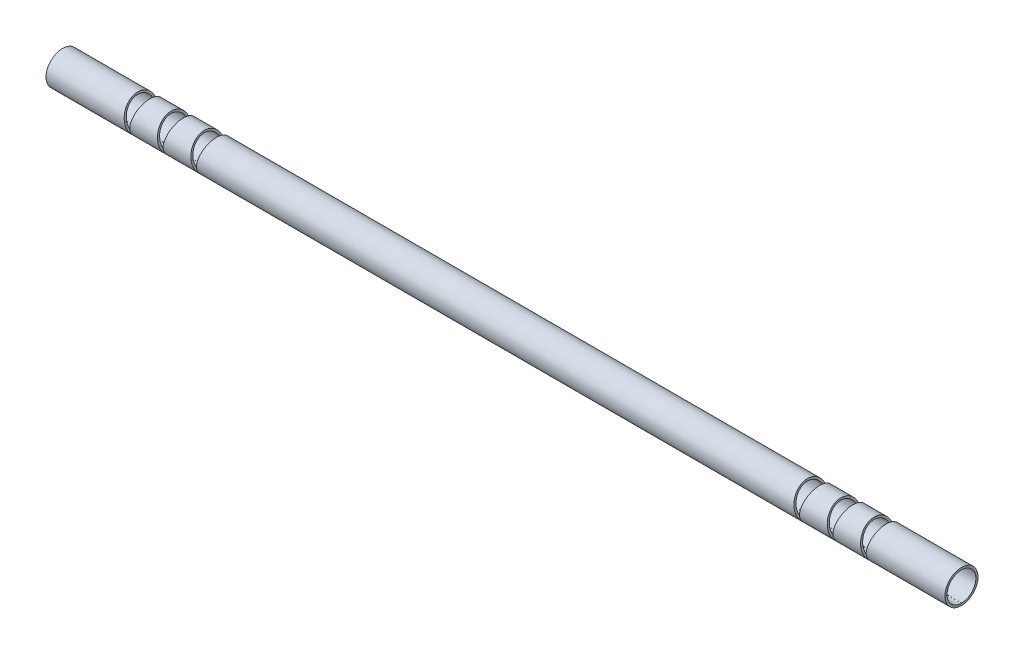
ISO-10303-21;
HEADER;
FILE_DESCRIPTION(('STEP AP214'),'2;1');
FILE_NAME('part.step','',(''),(''),'','','');
FILE_SCHEMA(('AUTOMOTIVE_DESIGN { 1 0 10303 214 1 1 1 1 }'));
ENDSEC;
DATA;
#1=APPLICATION_CONTEXT('core data for automotive mechanical design processes');
#2=APPLICATION_PROTOCOL_DEFINITION('international standard','automotive_design',2000,#1);
#3=PRODUCT_CONTEXT('',#1,'mechanical');
#4=PRODUCT('Part','Part','',(#3));
#5=PRODUCT_RELATED_PRODUCT_CATEGORY('part','',(#4));
#6=PRODUCT_DEFINITION_FORMATION('','',#4);
#7=PRODUCT_DEFINITION_CONTEXT('part definition',#1,'design');
#8=PRODUCT_DEFINITION('design','',#6,#7);
#9=PRODUCT_DEFINITION_SHAPE('','',#8);
#10=(LENGTH_UNIT() NAMED_UNIT(*) SI_UNIT(.MILLI.,.METRE.));
#11=(NAMED_UNIT(*) PLANE_ANGLE_UNIT() SI_UNIT($,.RADIAN.));
#12=(NAMED_UNIT(*) SI_UNIT($,.STERADIAN.) SOLID_ANGLE_UNIT());
#13=UNCERTAINTY_MEASURE_WITH_UNIT(LENGTH_MEASURE(1.E-05),#10,'distance_accuracy_value','');
#14=(GEOMETRIC_REPRESENTATION_CONTEXT(3) GLOBAL_UNCERTAINTY_ASSIGNED_CONTEXT((#13)) GLOBAL_UNIT_ASSIGNED_CONTEXT((#10,
#11,#12)) REPRESENTATION_CONTEXT('',''));
#15=CARTESIAN_POINT('',(0.,0.,0.));
#16=DIRECTION('',(0.,0.,1.));
#17=DIRECTION('',(1.,0.,0.));
#18=AXIS2_PLACEMENT_3D('',#15,#16,#17);
#19=CARTESIAN_POINT('',(548.5,0.,0.));
#20=DIRECTION('',(-1.,0.,0.));
#21=DIRECTION('',(0.,0.,1.));
#22=AXIS2_PLACEMENT_3D('',#19,#20,#21);
#23=CYLINDRICAL_SURFACE('',#22,15.5);
#24=CARTESIAN_POINT('',(-311.339139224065,0.,0.));
#25=DIRECTION('',(0.985322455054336,-0.170703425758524,0.));
#26=DIRECTION('',(-0.170703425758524,-0.985322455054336,0.));
#27=AXIS2_PLACEMENT_3D('',#24,#25,#26);
#28=ELLIPSE('',#27,15.7308908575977,15.5);
#29=CARTESIAN_POINT('',(-311.339139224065,-1.92449996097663E-12,15.5));
#30=VERTEX_POINT('',#29);
#31=CARTESIAN_POINT('',(-313.925,-14.9259259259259,4.17932234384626));
#32=VERTEX_POINT('',#31);
#33=EDGE_CURVE('E686',#30,#32,#28,.T.);
#34=ORIENTED_EDGE('',*,*,#33,.T.);
#35=CARTESIAN_POINT('',(-316.510860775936,0.,0.));
#36=DIRECTION('',(-0.985322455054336,-0.170703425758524,0.));
#37=DIRECTION('',(-0.170703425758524,0.985322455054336,0.));
#38=AXIS2_PLACEMENT_3D('',#35,#36,#37);
#39=ELLIPSE('',#38,15.7308908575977,15.5);
#40=CARTESIAN_POINT('',(-316.510860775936,2.40633675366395E-12,15.5));
#41=VERTEX_POINT('',#40);
#42=EDGE_CURVE('E1320',#32,#41,#39,.T.);
#43=ORIENTED_EDGE('',*,*,#42,.T.);
#44=CARTESIAN_POINT('',(-316.510860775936,0.,0.));
#45=DIRECTION('',(-0.980785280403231,-0.195090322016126,0.));
#46=DIRECTION('',(-0.195090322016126,0.980785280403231,0.));
#47=AXIS2_PLACEMENT_3D('',#44,#45,#46);
#48=ELLIPSE('',#47,15.8036629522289,15.5);
#49=CARTESIAN_POINT('',(-316.510860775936,2.40669134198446E-12,-15.5));
#50=VERTEX_POINT('',#49);
#51=EDGE_CURVE('E425',#41,#50,#48,.T.);
#52=ORIENTED_EDGE('',*,*,#51,.T.);
#53=CARTESIAN_POINT('',(-313.925,-14.9259259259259,-4.17932234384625));
#54=VERTEX_POINT('',#53);
#55=EDGE_CURVE('E1319',#50,#54,#39,.T.);
#56=ORIENTED_EDGE('',*,*,#55,.T.);
#57=CARTESIAN_POINT('',(-311.339139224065,-1.9386213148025E-12,-15.5));
#58=VERTEX_POINT('',#57);
#59=EDGE_CURVE('E1316',#54,#58,#28,.T.);
#60=ORIENTED_EDGE('',*,*,#59,.T.);
#61=CARTESIAN_POINT('',(-311.339139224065,0.,0.));
#62=DIRECTION('',(0.980785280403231,-0.195090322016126,0.));
#63=DIRECTION('',(-0.195090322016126,-0.980785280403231,0.));
#64=AXIS2_PLACEMENT_3D('',#61,#62,#63);
#65=ELLIPSE('',#64,15.8036629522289,15.5);
#66=EDGE_CURVE('E730',#58,#30,#65,.T.);
#67=ORIENTED_EDGE('',*,*,#66,.T.);
#68=EDGE_LOOP('',(#34,#43,#52,#56,#60,#67));
#69=FACE_BOUND('',#68,.T.);
#70=CARTESIAN_POINT('',(347.750860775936,0.,0.));
#71=DIRECTION('',(-0.985322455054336,0.170703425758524,0.));
#72=DIRECTION('',(-0.170703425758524,-0.985322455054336,0.));
#73=AXIS2_PLACEMENT_3D('',#70,#71,#72);
#74=ELLIPSE('',#73,15.7308908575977,15.5);
#75=CARTESIAN_POINT('',(345.165,-14.9259259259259,4.17932234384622));
#76=VERTEX_POINT('',#75);
#77=CARTESIAN_POINT('',(347.750860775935,-1.88635959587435E-12,15.5));
#78=VERTEX_POINT('',#77);
#79=EDGE_CURVE('E692',#76,#78,#74,.T.);
#80=ORIENTED_EDGE('',*,*,#79,.F.);
#81=CARTESIAN_POINT('',(342.579139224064,0.,0.));
#82=DIRECTION('',(0.985322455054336,0.170703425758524,0.));
#83=DIRECTION('',(-0.170703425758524,0.985322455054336,0.));
#84=AXIS2_PLACEMENT_3D('',#81,#82,#83);
#85=ELLIPSE('',#84,15.7308908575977,15.5);
#86=CARTESIAN_POINT('',(342.579139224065,-4.06424749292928E-12,15.5));
#87=VERTEX_POINT('',#86);
#88=EDGE_CURVE('E772',#87,#76,#85,.T.);
#89=ORIENTED_EDGE('',*,*,#88,.F.);
#90=CARTESIAN_POINT('',(342.579139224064,0.,0.));
#91=DIRECTION('',(0.980785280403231,0.195090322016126,0.));
#92=DIRECTION('',(-0.195090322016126,0.980785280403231,0.));
#93=AXIS2_PLACEMENT_3D('',#90,#91,#92);
#94=ELLIPSE('',#93,15.8036629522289,15.5);
#95=CARTESIAN_POINT('',(342.579139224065,-4.06424749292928E-12,-15.5));
#96=VERTEX_POINT('',#95);
#97=EDGE_CURVE('E531',#96,#87,#94,.T.);
#98=ORIENTED_EDGE('',*,*,#97,.F.);
#99=CARTESIAN_POINT('',(345.165,-14.9259259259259,-4.17932234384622));
#100=VERTEX_POINT('',#99);
#101=EDGE_CURVE('E774',#100,#96,#85,.T.);
#102=ORIENTED_EDGE('',*,*,#101,.F.);
#103=CARTESIAN_POINT('',(347.750860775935,-1.88635959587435E-12,-15.5));
#104=VERTEX_POINT('',#103);
#105=EDGE_CURVE('E773',#104,#100,#74,.T.);
#106=ORIENTED_EDGE('',*,*,#105,.F.);
#107=CARTESIAN_POINT('',(347.750860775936,0.,0.));
#108=DIRECTION('',(-0.980785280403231,0.195090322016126,0.));
#109=DIRECTION('',(-0.195090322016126,-0.980785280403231,0.));
#110=AXIS2_PLACEMENT_3D('',#107,#108,#109);
#111=ELLIPSE('',#110,15.8036629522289,15.5);
#112=EDGE_CURVE('E803',#78,#104,#111,.T.);
#113=ORIENTED_EDGE('',*,*,#112,.F.);
#114=EDGE_LOOP('',(#80,#89,#98,#102,#106,#113));
#115=FACE_BOUND('',#114,.T.);
#116=CARTESIAN_POINT('',(285.270860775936,0.,0.));
#117=DIRECTION('',(-0.985322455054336,0.170703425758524,0.));
#118=DIRECTION('',(-0.170703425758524,-0.985322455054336,0.));
#119=AXIS2_PLACEMENT_3D('',#116,#117,#118);
#120=ELLIPSE('',#119,15.7308908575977,15.5);
#121=CARTESIAN_POINT('',(282.685,-14.9259259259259,4.17932234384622));
#122=VERTEX_POINT('',#121);
#123=CARTESIAN_POINT('',(285.270860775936,7.02057818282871E-13,15.5));
#124=VERTEX_POINT('',#123);
#125=EDGE_CURVE('E698',#122,#124,#120,.T.);
#126=ORIENTED_EDGE('',*,*,#125,.F.);
#127=CARTESIAN_POINT('',(280.099139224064,0.,0.));
#128=DIRECTION('',(0.985322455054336,0.170703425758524,0.));
#129=DIRECTION('',(-0.170703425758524,0.985322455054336,0.));
#130=AXIS2_PLACEMENT_3D('',#127,#128,#129);
#131=ELLIPSE('',#130,15.7308908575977,15.5);
#132=CARTESIAN_POINT('',(280.099139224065,-6.68800220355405E-13,15.5));
#133=VERTEX_POINT('',#132);
#134=EDGE_CURVE('E867',#133,#122,#131,.T.);
#135=ORIENTED_EDGE('',*,*,#134,.F.);
#136=CARTESIAN_POINT('',(280.099139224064,0.,0.));
#137=DIRECTION('',(0.980785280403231,0.195090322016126,0.));
#138=DIRECTION('',(-0.195090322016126,0.980785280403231,0.));
#139=AXIS2_PLACEMENT_3D('',#136,#137,#138);
#140=ELLIPSE('',#139,15.8036629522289,15.5);
#141=CARTESIAN_POINT('',(280.099139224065,-6.68800220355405E-13,-15.5));
#142=VERTEX_POINT('',#141);
#143=EDGE_CURVE('E637',#142,#133,#140,.T.);
#144=ORIENTED_EDGE('',*,*,#143,.F.);
#145=CARTESIAN_POINT('',(282.685,-14.9259259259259,-4.17932234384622));
#146=VERTEX_POINT('',#145);
#147=EDGE_CURVE('E869',#146,#142,#131,.T.);
#148=ORIENTED_EDGE('',*,*,#147,.F.);
#149=CARTESIAN_POINT('',(285.270860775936,2.86487669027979E-12,-15.5));
#150=VERTEX_POINT('',#149);
#151=EDGE_CURVE('E868',#150,#146,#120,.T.);
#152=ORIENTED_EDGE('',*,*,#151,.F.);
#153=CARTESIAN_POINT('',(285.270860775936,0.,0.));
#154=DIRECTION('',(-0.980785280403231,0.195090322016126,0.));
#155=DIRECTION('',(-0.195090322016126,-0.980785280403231,0.));
#156=AXIS2_PLACEMENT_3D('',#153,#154,#155);
#157=ELLIPSE('',#156,15.8036629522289,15.5);
#158=EDGE_CURVE('E898',#124,#150,#157,.T.);
#159=ORIENTED_EDGE('',*,*,#158,.F.);
#160=EDGE_LOOP('',(#126,#135,#144,#148,#152,#159));
#161=FACE_BOUND('',#160,.T.);
#162=CARTESIAN_POINT('',(421.355,0.,0.));
#163=DIRECTION('',(1.,0.,0.));
#164=DIRECTION('',(0.,0.,-1.));
#165=AXIS2_PLACEMENT_3D('',#162,#163,#164);
#166=CIRCLE('',#165,15.5);
#167=CARTESIAN_POINT('',(421.355,-15.4999193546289,-0.0500000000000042));
#168=VERTEX_POINT('',#167);
#169=CARTESIAN_POINT('',(421.355,-15.4999193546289,0.0499999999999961));
#170=VERTEX_POINT('',#169);
#171=EDGE_CURVE('E702',#168,#170,#166,.T.);
#172=ORIENTED_EDGE('',*,*,#171,.F.);
#173=DIRECTION('',(-1.,0.,0.));
#174=VECTOR('',#173,1.);
#175=CARTESIAN_POINT('',(548.5,-15.4999193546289,-0.0500000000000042));
#176=LINE('',#175,#174);
#177=CARTESIAN_POINT('',(-421.355,-15.4999193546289,-0.0500000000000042));
#178=VERTEX_POINT('',#177);
#179=EDGE_CURVE('E925',#168,#178,#176,.T.);
#180=ORIENTED_EDGE('',*,*,#179,.T.);
#181=CARTESIAN_POINT('',(-421.355,0.,0.));
#182=DIRECTION('',(1.,0.,0.));
#183=DIRECTION('',(0.,0.,-1.));
#184=AXIS2_PLACEMENT_3D('',#181,#182,#183);
#185=CIRCLE('',#184,15.5);
#186=CARTESIAN_POINT('',(-421.355,-15.4999193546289,0.0499999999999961));
#187=VERTEX_POINT('',#186);
#188=EDGE_CURVE('E922',#178,#187,#185,.T.);
#189=ORIENTED_EDGE('',*,*,#188,.T.);
#190=DIRECTION('',(-1.,0.,0.));
#191=VECTOR('',#190,1.);
#192=CARTESIAN_POINT('',(548.5,-15.4999193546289,0.0499999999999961));
#193=LINE('',#192,#191);
#194=EDGE_CURVE('E931',#170,#187,#193,.T.);
#195=ORIENTED_EDGE('',*,*,#194,.F.);
#196=EDGE_LOOP('',(#172,#180,#189,#195));
#197=FACE_BOUND('',#196,.T.);
#198=CARTESIAN_POINT('',(316.510860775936,0.,0.));
#199=DIRECTION('',(-0.985322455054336,0.170703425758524,0.));
#200=DIRECTION('',(-0.170703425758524,-0.985322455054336,0.));
#201=AXIS2_PLACEMENT_3D('',#198,#199,#200);
#202=ELLIPSE('',#201,15.7308908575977,15.5);
#203=CARTESIAN_POINT('',(313.925,-14.9259259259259,4.17932234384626));
#204=VERTEX_POINT('',#203);
#205=CARTESIAN_POINT('',(316.510860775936,2.2293340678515E-13,15.5));
#206=VERTEX_POINT('',#205);
#207=EDGE_CURVE('E709',#204,#206,#202,.T.);
#208=ORIENTED_EDGE('',*,*,#207,.F.);
#209=CARTESIAN_POINT('',(311.339139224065,0.,0.));
#210=DIRECTION('',(0.985322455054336,0.170703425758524,0.));
#211=DIRECTION('',(-0.170703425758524,0.985322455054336,0.));
#212=AXIS2_PLACEMENT_3D('',#209,#210,#211);
#213=ELLIPSE('',#212,15.7308908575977,15.5);
#214=CARTESIAN_POINT('',(311.339139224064,2.57230853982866E-13,15.5));
#215=VERTEX_POINT('',#214);
#216=EDGE_CURVE('E820',#215,#204,#213,.T.);
#217=ORIENTED_EDGE('',*,*,#216,.F.);
#218=CARTESIAN_POINT('',(311.339139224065,0.,0.));
#219=DIRECTION('',(0.980785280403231,0.195090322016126,0.));
#220=DIRECTION('',(-0.195090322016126,0.980785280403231,0.));
#221=AXIS2_PLACEMENT_3D('',#218,#219,#220);
#222=ELLIPSE('',#221,15.8036629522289,15.5);
#223=CARTESIAN_POINT('',(311.339139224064,2.57230853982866E-13,-15.5));
#224=VERTEX_POINT('',#223);
#225=EDGE_CURVE('E584',#224,#215,#222,.T.);
#226=ORIENTED_EDGE('',*,*,#225,.F.);
#227=CARTESIAN_POINT('',(313.925,-14.9259259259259,-4.17932234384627));
#228=VERTEX_POINT('',#227);
#229=EDGE_CURVE('E822',#228,#224,#213,.T.);
#230=ORIENTED_EDGE('',*,*,#229,.F.);
#231=CARTESIAN_POINT('',(316.510860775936,2.2293340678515E-13,-15.5));
#232=VERTEX_POINT('',#231);
#233=EDGE_CURVE('E821',#232,#228,#202,.T.);
#234=ORIENTED_EDGE('',*,*,#233,.F.);
#235=CARTESIAN_POINT('',(316.510860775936,0.,0.));
#236=DIRECTION('',(-0.980785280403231,0.195090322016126,0.));
#237=DIRECTION('',(-0.195090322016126,-0.980785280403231,0.));
#238=AXIS2_PLACEMENT_3D('',#235,#236,#237);
#239=ELLIPSE('',#238,15.8036629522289,15.5);
#240=EDGE_CURVE('E851',#206,#232,#239,.T.);
#241=ORIENTED_EDGE('',*,*,#240,.F.);
#242=EDGE_LOOP('',(#208,#217,#226,#230,#234,#241));
#243=FACE_BOUND('',#242,.T.);
#244=CARTESIAN_POINT('',(-342.579139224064,0.,0.));
#245=DIRECTION('',(0.985322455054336,-0.170703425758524,0.));
#246=DIRECTION('',(-0.170703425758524,-0.985322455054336,0.));
#247=AXIS2_PLACEMENT_3D('',#244,#245,#246);
#248=ELLIPSE('',#247,15.7308908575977,15.5);
#249=CARTESIAN_POINT('',(-342.579139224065,-1.84189936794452E-12,15.5));
#250=VERTEX_POINT('',#249);
#251=CARTESIAN_POINT('',(-345.165,-14.9259259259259,4.17932234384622));
#252=VERTEX_POINT('',#251);
#253=EDGE_CURVE('E714',#250,#252,#248,.T.);
#254=ORIENTED_EDGE('',*,*,#253,.T.);
#255=CARTESIAN_POINT('',(-347.750860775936,0.,0.));
#256=DIRECTION('',(-0.985322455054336,-0.170703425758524,0.));
#257=DIRECTION('',(-0.170703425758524,0.985322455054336,0.));
#258=AXIS2_PLACEMENT_3D('',#255,#256,#257);
#259=ELLIPSE('',#258,15.7308908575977,15.5);
#260=CARTESIAN_POINT('',(-347.750860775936,2.50270411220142E-12,15.5));
#261=VERTEX_POINT('',#260);
#262=EDGE_CURVE('E716',#252,#261,#259,.T.);
#263=ORIENTED_EDGE('',*,*,#262,.T.);
#264=CARTESIAN_POINT('',(-347.750860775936,0.,0.));
#265=DIRECTION('',(-0.980785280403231,-0.195090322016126,0.));
#266=DIRECTION('',(-0.195090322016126,0.980785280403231,0.));
#267=AXIS2_PLACEMENT_3D('',#264,#265,#266);
#268=ELLIPSE('',#267,15.8036629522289,15.5);
#269=CARTESIAN_POINT('',(-347.750860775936,2.50650039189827E-12,-15.5));
#270=VERTEX_POINT('',#269);
#271=EDGE_CURVE('E478',#261,#270,#268,.T.);
#272=ORIENTED_EDGE('',*,*,#271,.T.);
#273=CARTESIAN_POINT('',(-345.165,-14.9259259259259,-4.17932234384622));
#274=VERTEX_POINT('',#273);
#275=EDGE_CURVE('E724',#270,#274,#259,.T.);
#276=ORIENTED_EDGE('',*,*,#275,.T.);
#277=CARTESIAN_POINT('',(-342.579139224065,-1.84225395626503E-12,-15.5));
#278=VERTEX_POINT('',#277);
#279=EDGE_CURVE('E721',#274,#278,#248,.T.);
#280=ORIENTED_EDGE('',*,*,#279,.T.);
#281=CARTESIAN_POINT('',(-342.579139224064,0.,0.));
#282=DIRECTION('',(0.980785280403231,-0.195090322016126,0.));
#283=DIRECTION('',(-0.195090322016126,-0.980785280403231,0.));
#284=AXIS2_PLACEMENT_3D('',#281,#282,#283);
#285=ELLIPSE('',#284,15.8036629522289,15.5);
#286=EDGE_CURVE('E719',#278,#250,#285,.T.);
#287=ORIENTED_EDGE('',*,*,#286,.T.);
#288=EDGE_LOOP('',(#254,#263,#272,#276,#280,#287));
#289=FACE_BOUND('',#288,.T.);
#290=CARTESIAN_POINT('',(-280.099139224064,0.,0.));
#291=DIRECTION('',(0.985322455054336,-0.170703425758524,0.));
#292=DIRECTION('',(-0.170703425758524,-0.985322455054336,0.));
#293=AXIS2_PLACEMENT_3D('',#290,#291,#292);
#294=ELLIPSE('',#293,15.7308908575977,15.5);
#295=CARTESIAN_POINT('',(-280.099139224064,1.00782109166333E-12,15.5));
#296=VERTEX_POINT('',#295);
#297=CARTESIAN_POINT('',(-282.685,-14.9259259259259,4.17932234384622));
#298=VERTEX_POINT('',#297);
#299=EDGE_CURVE('E310',#296,#298,#294,.T.);
#300=ORIENTED_EDGE('',*,*,#299,.T.);
#301=CARTESIAN_POINT('',(-285.270860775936,0.,0.));
#302=DIRECTION('',(-0.985322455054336,-0.170703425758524,0.));
#303=DIRECTION('',(-0.170703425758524,0.985322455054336,0.));
#304=AXIS2_PLACEMENT_3D('',#301,#302,#303);
#305=ELLIPSE('',#304,15.7308908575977,15.5);
#306=CARTESIAN_POINT('',(-285.270860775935,-1.91642761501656E-12,15.5));
#307=VERTEX_POINT('',#306);
#308=EDGE_CURVE('E294',#298,#307,#305,.T.);
#309=ORIENTED_EDGE('',*,*,#308,.T.);
#310=CARTESIAN_POINT('',(-285.270860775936,0.,0.));
#311=DIRECTION('',(-0.980785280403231,-0.195090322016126,0.));
#312=DIRECTION('',(-0.195090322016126,0.980785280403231,0.));
#313=AXIS2_PLACEMENT_3D('',#310,#311,#312);
#314=ELLIPSE('',#313,15.8036629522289,15.5);
#315=CARTESIAN_POINT('',(-285.270860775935,-1.89886456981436E-12,-15.5));
#316=VERTEX_POINT('',#315);
#317=EDGE_CURVE('E377',#307,#316,#314,.T.);
#318=ORIENTED_EDGE('',*,*,#317,.T.);
#319=CARTESIAN_POINT('',(-282.685,-14.9259259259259,-4.17932234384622));
#320=VERTEX_POINT('',#319);
#321=EDGE_CURVE('E305',#316,#320,#305,.T.);
#322=ORIENTED_EDGE('',*,*,#321,.T.);
#323=CARTESIAN_POINT('',(-280.099139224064,3.18605714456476E-12,-15.5));
#324=VERTEX_POINT('',#323);
#325=EDGE_CURVE('E318',#320,#324,#294,.T.);
#326=ORIENTED_EDGE('',*,*,#325,.T.);
#327=CARTESIAN_POINT('',(-280.099139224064,0.,0.));
#328=DIRECTION('',(0.980785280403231,-0.195090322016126,0.));
#329=DIRECTION('',(-0.195090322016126,-0.980785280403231,0.));
#330=AXIS2_PLACEMENT_3D('',#327,#328,#329);
#331=ELLIPSE('',#330,15.8036629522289,15.5);
#332=EDGE_CURVE('E317',#324,#296,#331,.T.);
#333=ORIENTED_EDGE('',*,*,#332,.T.);
#334=EDGE_LOOP('',(#300,#309,#318,#322,#326,#333));
#335=FACE_BOUND('',#334,.T.);
#336=ADVANCED_FACE('F37',(#69,#115,#161,#197,#243,#289,#335),#23,.T.);
#337=CARTESIAN_POINT('',(548.5,0.,0.));
#338=DIRECTION('',(-1.,0.,0.));
#339=DIRECTION('',(0.,0.,1.));
#340=AXIS2_PLACEMENT_3D('',#337,#338,#339);
#341=CYLINDRICAL_SURFACE('',#340,13.5);
#342=CARTESIAN_POINT('',(-316.510860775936,0.,0.));
#343=DIRECTION('',(-0.980785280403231,-0.195090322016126,0.));
#344=DIRECTION('',(-0.195090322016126,0.980785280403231,0.));
#345=AXIS2_PLACEMENT_3D('',#342,#343,#344);
#346=ELLIPSE('',#345,13.7644806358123,13.5);
#347=CARTESIAN_POINT('',(-313.925,-13.,3.64005494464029));
#348=VERTEX_POINT('',#347);
#349=CARTESIAN_POINT('',(-316.510860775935,-4.96650901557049E-12,13.5));
#350=VERTEX_POINT('',#349);
#351=EDGE_CURVE('E1327',#348,#350,#346,.T.);
#352=ORIENTED_EDGE('',*,*,#351,.F.);
#353=CARTESIAN_POINT('',(-311.339139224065,0.,0.));
#354=DIRECTION('',(0.980785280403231,-0.195090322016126,0.));
#355=DIRECTION('',(-0.195090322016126,-0.980785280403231,0.));
#356=AXIS2_PLACEMENT_3D('',#353,#354,#355);
#357=ELLIPSE('',#356,13.7644806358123,13.5);
#358=CARTESIAN_POINT('',(-311.339139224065,-1.6881677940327E-12,13.5));
#359=VERTEX_POINT('',#358);
#360=EDGE_CURVE('E1326',#359,#348,#357,.T.);
#361=ORIENTED_EDGE('',*,*,#360,.F.);
#362=CARTESIAN_POINT('',(-311.339139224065,0.,0.));
#363=DIRECTION('',(0.974898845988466,-0.22264824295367,0.));
#364=DIRECTION('',(-0.22264824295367,-0.974898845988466,0.));
#365=AXIS2_PLACEMENT_3D('',#362,#363,#364);
#366=ELLIPSE('',#365,13.8475905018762,13.5);
#367=CARTESIAN_POINT('',(-311.339139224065,-1.73985256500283E-12,-13.5));
#368=VERTEX_POINT('',#367);
#369=EDGE_CURVE('E1349',#368,#359,#366,.T.);
#370=ORIENTED_EDGE('',*,*,#369,.F.);
#371=CARTESIAN_POINT('',(-313.925,-13.,-3.64005494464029));
#372=VERTEX_POINT('',#371);
#373=EDGE_CURVE('E1323',#372,#368,#357,.T.);
#374=ORIENTED_EDGE('',*,*,#373,.F.);
#375=CARTESIAN_POINT('',(-316.510860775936,2.0643209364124E-13,-13.5));
#376=VERTEX_POINT('',#375);
#377=EDGE_CURVE('E1325',#376,#372,#346,.T.);
#378=ORIENTED_EDGE('',*,*,#377,.F.);
#379=CARTESIAN_POINT('',(-316.510860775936,0.,0.));
#380=DIRECTION('',(-0.974898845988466,-0.22264824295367,0.));
#381=DIRECTION('',(-0.22264824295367,0.974898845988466,0.));
#382=AXIS2_PLACEMENT_3D('',#379,#380,#381);
#383=ELLIPSE('',#382,13.8475905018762,13.5);
#384=EDGE_CURVE('E426',#350,#376,#383,.T.);
#385=ORIENTED_EDGE('',*,*,#384,.F.);
#386=EDGE_LOOP('',(#352,#361,#370,#374,#378,#385));
#387=FACE_BOUND('',#386,.T.);
#388=CARTESIAN_POINT('',(342.579139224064,0.,0.));
#389=DIRECTION('',(0.980785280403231,0.195090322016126,0.));
#390=DIRECTION('',(-0.195090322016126,0.980785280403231,0.));
#391=AXIS2_PLACEMENT_3D('',#388,#389,#390);
#392=ELLIPSE('',#391,13.7644806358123,13.5);
#393=CARTESIAN_POINT('',(342.579139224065,-4.44391103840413E-12,13.5));
#394=VERTEX_POINT('',#393);
#395=CARTESIAN_POINT('',(345.165,-13.,3.64005494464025));
#396=VERTEX_POINT('',#395);
#397=EDGE_CURVE('E779',#394,#396,#392,.T.);
#398=ORIENTED_EDGE('',*,*,#397,.T.);
#399=CARTESIAN_POINT('',(347.750860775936,0.,0.));
#400=DIRECTION('',(-0.980785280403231,0.195090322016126,0.));
#401=DIRECTION('',(-0.195090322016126,-0.980785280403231,0.));
#402=AXIS2_PLACEMENT_3D('',#399,#400,#401);
#403=ELLIPSE('',#402,13.7644806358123,13.5);
#404=CARTESIAN_POINT('',(347.750860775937,5.71260312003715E-12,13.5));
#405=VERTEX_POINT('',#404);
#406=EDGE_CURVE('E766',#396,#405,#403,.T.);
#407=ORIENTED_EDGE('',*,*,#406,.T.);
#408=CARTESIAN_POINT('',(347.750860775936,0.,0.));
#409=DIRECTION('',(-0.974898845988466,0.22264824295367,0.));
#410=DIRECTION('',(-0.22264824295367,-0.974898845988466,0.));
#411=AXIS2_PLACEMENT_3D('',#408,#409,#410);
#412=ELLIPSE('',#411,13.8475905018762,13.5);
#413=CARTESIAN_POINT('',(347.750860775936,1.86240651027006E-12,-13.5));
#414=VERTEX_POINT('',#413);
#415=EDGE_CURVE('E801',#405,#414,#412,.T.);
#416=ORIENTED_EDGE('',*,*,#415,.T.);
#417=CARTESIAN_POINT('',(345.165,-13.,-3.64005494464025));
#418=VERTEX_POINT('',#417);
#419=EDGE_CURVE('E764',#414,#418,#403,.T.);
#420=ORIENTED_EDGE('',*,*,#419,.T.);
#421=CARTESIAN_POINT('',(342.579139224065,-1.4883927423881E-12,-13.5));
#422=VERTEX_POINT('',#421);
#423=EDGE_CURVE('E780',#418,#422,#392,.T.);
#424=ORIENTED_EDGE('',*,*,#423,.T.);
#425=CARTESIAN_POINT('',(342.579139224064,0.,0.));
#426=DIRECTION('',(0.974898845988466,0.22264824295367,0.));
#427=DIRECTION('',(-0.22264824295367,0.974898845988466,0.));
#428=AXIS2_PLACEMENT_3D('',#425,#426,#427);
#429=ELLIPSE('',#428,13.8475905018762,13.5);
#430=EDGE_CURVE('E532',#422,#394,#429,.T.);
#431=ORIENTED_EDGE('',*,*,#430,.T.);
#432=EDGE_LOOP('',(#398,#407,#416,#420,#424,#431));
#433=FACE_BOUND('',#432,.T.);
#434=CARTESIAN_POINT('',(280.099139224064,0.,0.));
#435=DIRECTION('',(0.980785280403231,0.195090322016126,0.));
#436=DIRECTION('',(-0.195090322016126,0.980785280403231,0.));
#437=AXIS2_PLACEMENT_3D('',#434,#435,#436);
#438=ELLIPSE('',#437,13.7644806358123,13.5);
#439=CARTESIAN_POINT('',(280.099139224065,-5.43478572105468E-13,13.5));
#440=VERTEX_POINT('',#439);
#441=CARTESIAN_POINT('',(282.685,-13.,3.64005494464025));
#442=VERTEX_POINT('',#441);
#443=EDGE_CURVE('E874',#440,#442,#438,.T.);
#444=ORIENTED_EDGE('',*,*,#443,.T.);
#445=CARTESIAN_POINT('',(285.270860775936,0.,0.));
#446=DIRECTION('',(-0.980785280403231,0.195090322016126,0.));
#447=DIRECTION('',(-0.195090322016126,-0.980785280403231,0.));
#448=AXIS2_PLACEMENT_3D('',#445,#446,#447);
#449=ELLIPSE('',#448,13.7644806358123,13.5);
#450=CARTESIAN_POINT('',(285.270860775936,2.45121196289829E-12,13.5));
#451=VERTEX_POINT('',#450);
#452=EDGE_CURVE('E860',#442,#451,#449,.T.);
#453=ORIENTED_EDGE('',*,*,#452,.T.);
#454=CARTESIAN_POINT('',(285.270860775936,0.,0.));
#455=DIRECTION('',(-0.974898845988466,0.22264824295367,0.));
#456=DIRECTION('',(-0.22264824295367,-0.974898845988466,0.));
#457=AXIS2_PLACEMENT_3D('',#454,#455,#456);
#458=ELLIPSE('',#457,13.8475905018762,13.5);
#459=CARTESIAN_POINT('',(285.270860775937,4.32716609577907E-12,-13.5));
#460=VERTEX_POINT('',#459);
#461=EDGE_CURVE('E896',#451,#460,#458,.T.);
#462=ORIENTED_EDGE('',*,*,#461,.T.);
#463=CARTESIAN_POINT('',(282.685,-13.,-3.64005494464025));
#464=VERTEX_POINT('',#463);
#465=EDGE_CURVE('E858',#460,#464,#449,.T.);
#466=ORIENTED_EDGE('',*,*,#465,.T.);
#467=CARTESIAN_POINT('',(280.099139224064,8.37004077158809E-13,-13.5));
#468=VERTEX_POINT('',#467);
#469=EDGE_CURVE('E875',#464,#468,#438,.T.);
#470=ORIENTED_EDGE('',*,*,#469,.T.);
#471=CARTESIAN_POINT('',(280.099139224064,0.,0.));
#472=DIRECTION('',(0.974898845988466,0.22264824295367,0.));
#473=DIRECTION('',(-0.22264824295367,0.974898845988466,0.));
#474=AXIS2_PLACEMENT_3D('',#471,#472,#473);
#475=ELLIPSE('',#474,13.8475905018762,13.5);
#476=EDGE_CURVE('E638',#468,#440,#475,.T.);
#477=ORIENTED_EDGE('',*,*,#476,.T.);
#478=EDGE_LOOP('',(#444,#453,#462,#466,#470,#477));
#479=FACE_BOUND('',#478,.T.);
#480=DIRECTION('',(-1.,0.,0.));
#481=VECTOR('',#480,1.);
#482=CARTESIAN_POINT('',(548.5,-13.4999297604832,-0.0435483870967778));
#483=LINE('',#482,#481);
#484=CARTESIAN_POINT('',(421.355,-13.4999297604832,-0.0435483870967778));
#485=VERTEX_POINT('',#484);
#486=CARTESIAN_POINT('',(-421.355,-13.4999297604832,-0.0435483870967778));
#487=VERTEX_POINT('',#486);
#488=EDGE_CURVE('E927',#485,#487,#483,.T.);
#489=ORIENTED_EDGE('',*,*,#488,.F.);
#490=CARTESIAN_POINT('',(421.355,0.,0.));
#491=DIRECTION('',(1.,0.,0.));
#492=DIRECTION('',(0.,0.,-1.));
#493=AXIS2_PLACEMENT_3D('',#490,#491,#492);
#494=CIRCLE('',#493,13.5);
#495=CARTESIAN_POINT('',(421.355,-13.4999297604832,0.0435483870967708));
#496=VERTEX_POINT('',#495);
#497=EDGE_CURVE('E905',#485,#496,#494,.T.);
#498=ORIENTED_EDGE('',*,*,#497,.T.);
#499=DIRECTION('',(-1.,0.,0.));
#500=VECTOR('',#499,1.);
#501=CARTESIAN_POINT('',(548.5,-13.4999297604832,0.0435483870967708));
#502=LINE('',#501,#500);
#503=CARTESIAN_POINT('',(-421.355,-13.4999297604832,0.0435483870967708));
#504=VERTEX_POINT('',#503);
#505=EDGE_CURVE('E929',#496,#504,#502,.T.);
#506=ORIENTED_EDGE('',*,*,#505,.T.);
#507=CARTESIAN_POINT('',(-421.355,0.,0.));
#508=DIRECTION('',(1.,0.,0.));
#509=DIRECTION('',(0.,0.,-1.));
#510=AXIS2_PLACEMENT_3D('',#507,#508,#509);
#511=CIRCLE('',#510,13.5);
#512=EDGE_CURVE('E916',#487,#504,#511,.T.);
#513=ORIENTED_EDGE('',*,*,#512,.F.);
#514=EDGE_LOOP('',(#489,#498,#506,#513));
#515=FACE_BOUND('',#514,.T.);
#516=CARTESIAN_POINT('',(311.339139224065,0.,0.));
#517=DIRECTION('',(0.980785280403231,0.195090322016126,0.));
#518=DIRECTION('',(-0.195090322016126,0.980785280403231,0.));
#519=AXIS2_PLACEMENT_3D('',#516,#517,#518);
#520=ELLIPSE('',#519,13.7644806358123,13.5);
#521=CARTESIAN_POINT('',(311.339139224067,-1.03888092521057E-11,13.5));
#522=VERTEX_POINT('',#521);
#523=CARTESIAN_POINT('',(313.925,-13.,3.64005494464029));
#524=VERTEX_POINT('',#523);
#525=EDGE_CURVE('E827',#522,#524,#520,.T.);
#526=ORIENTED_EDGE('',*,*,#525,.T.);
#527=CARTESIAN_POINT('',(316.510860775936,0.,0.));
#528=DIRECTION('',(-0.980785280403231,0.195090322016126,0.));
#529=DIRECTION('',(-0.195090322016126,-0.980785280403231,0.));
#530=AXIS2_PLACEMENT_3D('',#527,#528,#529);
#531=ELLIPSE('',#530,13.7644806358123,13.5);
#532=CARTESIAN_POINT('',(316.510860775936,3.13466525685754E-12,13.5));
#533=VERTEX_POINT('',#532);
#534=EDGE_CURVE('E813',#524,#533,#531,.T.);
#535=ORIENTED_EDGE('',*,*,#534,.T.);
#536=CARTESIAN_POINT('',(316.510860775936,0.,0.));
#537=DIRECTION('',(-0.974898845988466,0.22264824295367,0.));
#538=DIRECTION('',(-0.22264824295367,-0.974898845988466,0.));
#539=AXIS2_PLACEMENT_3D('',#536,#537,#538);
#540=ELLIPSE('',#539,13.8475905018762,13.5);
#541=CARTESIAN_POINT('',(316.510860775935,-4.43027344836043E-12,-13.5));
#542=VERTEX_POINT('',#541);
#543=EDGE_CURVE('E849',#533,#542,#540,.T.);
#544=ORIENTED_EDGE('',*,*,#543,.T.);
#545=CARTESIAN_POINT('',(313.925,-13.,-3.64005494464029));
#546=VERTEX_POINT('',#545);
#547=EDGE_CURVE('E811',#542,#546,#531,.T.);
#548=ORIENTED_EDGE('',*,*,#547,.T.);
#549=CARTESIAN_POINT('',(311.339139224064,9.93996551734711E-13,-13.5));
#550=VERTEX_POINT('',#549);
#551=EDGE_CURVE('E828',#546,#550,#520,.T.);
#552=ORIENTED_EDGE('',*,*,#551,.T.);
#553=CARTESIAN_POINT('',(311.339139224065,0.,0.));
#554=DIRECTION('',(0.974898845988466,0.22264824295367,0.));
#555=DIRECTION('',(-0.22264824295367,0.974898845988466,0.));
#556=AXIS2_PLACEMENT_3D('',#553,#554,#555);
#557=ELLIPSE('',#556,13.8475905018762,13.5);
#558=EDGE_CURVE('E585',#550,#522,#557,.T.);
#559=ORIENTED_EDGE('',*,*,#558,.T.);
#560=EDGE_LOOP('',(#526,#535,#544,#548,#552,#559));
#561=FACE_BOUND('',#560,.T.);
#562=CARTESIAN_POINT('',(-347.750860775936,0.,0.));
#563=DIRECTION('',(-0.980785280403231,-0.195090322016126,0.));
#564=DIRECTION('',(-0.195090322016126,0.980785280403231,0.));
#565=AXIS2_PLACEMENT_3D('',#562,#563,#564);
#566=ELLIPSE('',#565,13.7644806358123,13.5);
#567=CARTESIAN_POINT('',(-345.165,-13.,3.64005494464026));
#568=VERTEX_POINT('',#567);
#569=CARTESIAN_POINT('',(-347.750860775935,-1.65715622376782E-12,13.5));
#570=VERTEX_POINT('',#569);
#571=EDGE_CURVE('E722',#568,#570,#566,.T.);
#572=ORIENTED_EDGE('',*,*,#571,.F.);
#573=CARTESIAN_POINT('',(-342.579139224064,0.,0.));
#574=DIRECTION('',(0.980785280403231,-0.195090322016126,0.));
#575=DIRECTION('',(-0.195090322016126,-0.980785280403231,0.));
#576=AXIS2_PLACEMENT_3D('',#573,#574,#575);
#577=ELLIPSE('',#576,13.7644806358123,13.5);
#578=CARTESIAN_POINT('',(-342.579139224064,2.14876297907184E-12,13.5));
#579=VERTEX_POINT('',#578);
#580=EDGE_CURVE('E735',#579,#568,#577,.T.);
#581=ORIENTED_EDGE('',*,*,#580,.F.);
#582=CARTESIAN_POINT('',(-342.579139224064,0.,0.));
#583=DIRECTION('',(0.974898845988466,-0.22264824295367,0.));
#584=DIRECTION('',(-0.22264824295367,-0.974898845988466,0.));
#585=AXIS2_PLACEMENT_3D('',#582,#583,#584);
#586=ELLIPSE('',#585,13.8475905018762,13.5);
#587=CARTESIAN_POINT('',(-342.579139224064,2.16658619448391E-12,-13.5));
#588=VERTEX_POINT('',#587);
#589=EDGE_CURVE('E755',#588,#579,#586,.T.);
#590=ORIENTED_EDGE('',*,*,#589,.F.);
#591=CARTESIAN_POINT('',(-345.165,-13.,-3.64005494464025));
#592=VERTEX_POINT('',#591);
#593=EDGE_CURVE('E734',#592,#588,#577,.T.);
#594=ORIENTED_EDGE('',*,*,#593,.F.);
#595=CARTESIAN_POINT('',(-347.750860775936,1.29063426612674E-12,-13.5));
#596=VERTEX_POINT('',#595);
#597=EDGE_CURVE('E726',#596,#592,#566,.T.);
#598=ORIENTED_EDGE('',*,*,#597,.F.);
#599=CARTESIAN_POINT('',(-347.750860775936,0.,0.));
#600=DIRECTION('',(-0.974898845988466,-0.22264824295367,0.));
#601=DIRECTION('',(-0.22264824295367,0.974898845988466,0.));
#602=AXIS2_PLACEMENT_3D('',#599,#600,#601);
#603=ELLIPSE('',#602,13.8475905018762,13.5);
#604=EDGE_CURVE('E479',#570,#596,#603,.T.);
#605=ORIENTED_EDGE('',*,*,#604,.F.);
#606=EDGE_LOOP('',(#572,#581,#590,#594,#598,#605));
#607=FACE_BOUND('',#606,.T.);
#608=CARTESIAN_POINT('',(-285.270860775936,0.,0.));
#609=DIRECTION('',(-0.980785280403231,-0.195090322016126,0.));
#610=DIRECTION('',(-0.195090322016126,0.980785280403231,0.));
#611=AXIS2_PLACEMENT_3D('',#608,#609,#610);
#612=ELLIPSE('',#611,13.7644806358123,13.5);
#613=CARTESIAN_POINT('',(-282.685,-13.,3.64005494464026));
#614=VERTEX_POINT('',#613);
#615=CARTESIAN_POINT('',(-285.270860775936,2.47953476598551E-12,13.5));
#616=VERTEX_POINT('',#615);
#617=EDGE_CURVE('E319',#614,#616,#612,.T.);
#618=ORIENTED_EDGE('',*,*,#617,.F.);
#619=CARTESIAN_POINT('',(-280.099139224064,0.,0.));
#620=DIRECTION('',(0.980785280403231,-0.195090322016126,0.));
#621=DIRECTION('',(-0.195090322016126,-0.980785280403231,0.));
#622=AXIS2_PLACEMENT_3D('',#619,#620,#621);
#623=ELLIPSE('',#622,13.7644806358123,13.5);
#624=CARTESIAN_POINT('',(-280.099139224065,-1.05267613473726E-12,13.5));
#625=VERTEX_POINT('',#624);
#626=EDGE_CURVE('E313',#625,#614,#623,.T.);
#627=ORIENTED_EDGE('',*,*,#626,.F.);
#628=CARTESIAN_POINT('',(-280.099139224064,0.,0.));
#629=DIRECTION('',(0.974898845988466,-0.22264824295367,0.));
#630=DIRECTION('',(-0.22264824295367,-0.974898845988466,0.));
#631=AXIS2_PLACEMENT_3D('',#628,#629,#630);
#632=ELLIPSE('',#631,13.8475905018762,13.5);
#633=CARTESIAN_POINT('',(-280.099139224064,8.42691867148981E-13,-13.5));
#634=VERTEX_POINT('',#633);
#635=EDGE_CURVE('E1312',#634,#625,#632,.T.);
#636=ORIENTED_EDGE('',*,*,#635,.F.);
#637=CARTESIAN_POINT('',(-282.685,-13.,-3.64005494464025));
#638=VERTEX_POINT('',#637);
#639=EDGE_CURVE('E324',#638,#634,#623,.T.);
#640=ORIENTED_EDGE('',*,*,#639,.F.);
#641=CARTESIAN_POINT('',(-285.270860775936,5.57713597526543E-13,-13.5));
#642=VERTEX_POINT('',#641);
#643=EDGE_CURVE('E321',#642,#638,#612,.T.);
#644=ORIENTED_EDGE('',*,*,#643,.F.);
#645=CARTESIAN_POINT('',(-285.270860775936,0.,0.));
#646=DIRECTION('',(-0.974898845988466,-0.22264824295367,0.));
#647=DIRECTION('',(-0.22264824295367,0.974898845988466,0.));
#648=AXIS2_PLACEMENT_3D('',#645,#646,#647);
#649=ELLIPSE('',#648,13.8475905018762,13.5);
#650=EDGE_CURVE('E59',#616,#642,#649,.T.);
#651=ORIENTED_EDGE('',*,*,#650,.F.);
#652=EDGE_LOOP('',(#618,#627,#636,#640,#644,#651));
#653=FACE_BOUND('',#652,.T.);
#654=ADVANCED_FACE('F660',(#387,#433,#479,#515,#561,#607,#653),#341,.F.);
#655=CARTESIAN_POINT('',(421.355,0.,0.));
#656=DIRECTION('',(1.,0.,0.));
#657=DIRECTION('',(0.,0.,-1.));
#658=AXIS2_PLACEMENT_3D('',#655,#656,#657);
#659=PLANE('',#658);
#660=DIRECTION('',(0.,0.999994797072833,0.00322580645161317));
#661=VECTOR('',#660,1.);
#662=CARTESIAN_POINT('',(421.355,-15.4999193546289,-0.0500000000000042));
#663=LINE('',#662,#661);
#664=EDGE_CURVE('E12',#168,#485,#663,.T.);
#665=ORIENTED_EDGE('',*,*,#664,.F.);
#666=ORIENTED_EDGE('',*,*,#171,.T.);
#667=DIRECTION('',(0.,-0.999994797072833,0.00322580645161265));
#668=VECTOR('',#667,1.);
#669=CARTESIAN_POINT('',(421.355,-13.4999297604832,0.0435483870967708));
#670=LINE('',#669,#668);
#671=EDGE_CURVE('E907',#496,#170,#670,.T.);
#672=ORIENTED_EDGE('',*,*,#671,.F.);
#673=ORIENTED_EDGE('',*,*,#497,.F.);
#674=EDGE_LOOP('',(#665,#666,#672,#673));
#675=FACE_BOUND('',#674,.T.);
#676=ADVANCED_FACE('F650',(#675),#659,.T.);
#677=CARTESIAN_POINT('',(548.5,-13.4999297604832,0.0435483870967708));
#678=DIRECTION('',(0.,-0.00322580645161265,-0.999994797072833));
#679=DIRECTION('',(0.,0.999994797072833,-0.00322580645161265));
#680=AXIS2_PLACEMENT_3D('',#677,#678,#679);
#681=PLANE('',#680);
#682=ORIENTED_EDGE('',*,*,#505,.F.);
#683=ORIENTED_EDGE('',*,*,#671,.T.);
#684=ORIENTED_EDGE('',*,*,#194,.T.);
#685=DIRECTION('',(0.,-0.999994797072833,0.00322580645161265));
#686=VECTOR('',#685,1.);
#687=CARTESIAN_POINT('',(-421.355,-13.4999297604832,0.0435483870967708));
#688=LINE('',#687,#686);
#689=EDGE_CURVE('E919',#504,#187,#688,.T.);
#690=ORIENTED_EDGE('',*,*,#689,.F.);
#691=EDGE_LOOP('',(#682,#683,#684,#690));
#692=FACE_BOUND('',#691,.T.);
#693=ADVANCED_FACE('F659',(#692),#681,.T.);
#694=CARTESIAN_POINT('',(548.5,-15.4999193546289,-0.0500000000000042));
#695=DIRECTION('',(0.,-0.00322580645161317,0.999994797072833));
#696=DIRECTION('',(0.,-0.999994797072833,-0.00322580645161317));
#697=AXIS2_PLACEMENT_3D('',#694,#695,#696);
#698=PLANE('',#697);
#699=ORIENTED_EDGE('',*,*,#179,.F.);
#700=ORIENTED_EDGE('',*,*,#664,.T.);
#701=ORIENTED_EDGE('',*,*,#488,.T.);
#702=DIRECTION('',(0.,0.999994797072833,0.00322580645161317));
#703=VECTOR('',#702,1.);
#704=CARTESIAN_POINT('',(-421.355,-15.4999193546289,-0.0500000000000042));
#705=LINE('',#704,#703);
#706=EDGE_CURVE('E44',#178,#487,#705,.T.);
#707=ORIENTED_EDGE('',*,*,#706,.F.);
#708=EDGE_LOOP('',(#699,#700,#701,#707));
#709=FACE_BOUND('',#708,.T.);
#710=ADVANCED_FACE('F665',(#709),#698,.T.);
#711=CARTESIAN_POINT('',(-421.355,0.,0.));
#712=DIRECTION('',(1.,0.,0.));
#713=DIRECTION('',(0.,0.,-1.));
#714=AXIS2_PLACEMENT_3D('',#711,#712,#713);
#715=PLANE('',#714);
#716=ORIENTED_EDGE('',*,*,#188,.F.);
#717=ORIENTED_EDGE('',*,*,#706,.T.);
#718=ORIENTED_EDGE('',*,*,#512,.T.);
#719=ORIENTED_EDGE('',*,*,#689,.T.);
#720=EDGE_LOOP('',(#716,#717,#718,#719));
#721=FACE_BOUND('',#720,.T.);
#722=ADVANCED_FACE('F662',(#721),#715,.F.);
#723=CARTESIAN_POINT('',(277.01599752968,13.5,0.));
#724=CARTESIAN_POINT('',(277.01599752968,14.1666666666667,0.));
#725=CARTESIAN_POINT('',(277.01599752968,14.8333333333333,0.));
#726=CARTESIAN_POINT('',(277.01599752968,15.5,0.));
#727=CARTESIAN_POINT('',(277.01599752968,13.5,27.));
#728=CARTESIAN_POINT('',(277.01599752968,14.1666666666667,28.3333333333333));
#729=CARTESIAN_POINT('',(277.01599752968,14.8333333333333,29.6666666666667));
#730=CARTESIAN_POINT('',(277.01599752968,15.5,31.));
#731=CARTESIAN_POINT('',(283.182280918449,-13.5,27.));
#732=CARTESIAN_POINT('',(283.182280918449,-14.1666666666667,28.3333333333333));
#733=CARTESIAN_POINT('',(283.182280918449,-14.8333333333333,29.6666666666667));
#734=CARTESIAN_POINT('',(283.182280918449,-15.5,31.));
#735=CARTESIAN_POINT('',(283.182280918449,-13.5,0.));
#736=CARTESIAN_POINT('',(283.182280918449,-14.1666666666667,0.));
#737=CARTESIAN_POINT('',(283.182280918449,-14.8333333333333,0.));
#738=CARTESIAN_POINT('',(283.182280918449,-15.5,0.));
#739=CARTESIAN_POINT('',(283.182280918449,-13.5,-27.));
#740=CARTESIAN_POINT('',(283.182280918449,-14.1666666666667,-28.3333333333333));
#741=CARTESIAN_POINT('',(283.182280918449,-14.8333333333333,-29.6666666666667));
#742=CARTESIAN_POINT('',(283.182280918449,-15.5,-31.));
#743=CARTESIAN_POINT('',(277.01599752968,13.5,-27.));
#744=CARTESIAN_POINT('',(277.01599752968,14.1666666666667,-28.3333333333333));
#745=CARTESIAN_POINT('',(277.01599752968,14.8333333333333,-29.6666666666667));
#746=CARTESIAN_POINT('',(277.01599752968,15.5,-31.));
#747=CARTESIAN_POINT('',(277.01599752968,13.5,0.));
#748=CARTESIAN_POINT('',(277.01599752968,14.1666666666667,0.));
#749=CARTESIAN_POINT('',(277.01599752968,14.8333333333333,0.));
#750=CARTESIAN_POINT('',(277.01599752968,15.5,0.));
#751=(BOUNDED_SURFACE() B_SPLINE_SURFACE(3,3,((#723,#724,#725,#726),(#727,#728,#729,#730),(#731,
#732,#733,#734),(#735,#736,#737,#738),(#739,#740,#741,#742),(#743,#744,#745,#746),(#747,#748,
#749,#750)),.UNSPECIFIED.,.T.,.F.,.F.) B_SPLINE_SURFACE_WITH_KNOTS((4,3,4),(4,4),(0.,0.5,1.),
(0.,1.),.UNSPECIFIED.) GEOMETRIC_REPRESENTATION_ITEM() RATIONAL_B_SPLINE_SURFACE(((1.,1.,1.,1.),
(0.333333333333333,0.333333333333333,0.333333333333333,0.333333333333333),(0.333333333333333,
0.333333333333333,0.333333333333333,0.333333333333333),(1.,1.,1.,1.),(0.333333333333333,
0.333333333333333,0.333333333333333,0.333333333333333),(0.333333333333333,0.333333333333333,
0.333333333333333,0.333333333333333),(1.,1.,1.,1.))) REPRESENTATION_ITEM('') SURFACE());
#752=CARTESIAN_POINT('',(280.099139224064,0.,-13.5));
#753=CARTESIAN_POINT('',(280.099139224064,2.06629508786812E-12,-13.6666666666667));
#754=CARTESIAN_POINT('',(280.099139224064,2.30923543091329E-12,-13.8333333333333));
#755=CARTESIAN_POINT('',(280.099139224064,1.4939153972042E-12,-14.1666666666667));
#756=CARTESIAN_POINT('',(280.099139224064,4.35655020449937E-13,-14.3333333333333));
#757=CARTESIAN_POINT('',(280.099139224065,-5.40280530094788E-13,-14.6666666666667));
#758=CARTESIAN_POINT('',(280.099139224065,-4.57955703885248E-13,-14.8333333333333));
#759=CARTESIAN_POINT('',(280.099139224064,3.76803171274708E-13,-15.1666666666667));
#760=CARTESIAN_POINT('',(280.099139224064,1.12923722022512E-12,-15.3333333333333));
#761=CARTESIAN_POINT('',(280.099139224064,1.98148789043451E-12,-15.5));
#762=B_SPLINE_CURVE_WITH_KNOTS('',3,(#752,#753,#754,#755,#756,#757,#758,#759,#760,#761),
.UNSPECIFIED.,.F.,.F.,(4,2,2,2,4),(0.,0.499999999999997,0.999999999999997,1.5,2.),.UNSPECIFIED.);
#763=EDGE_CURVE('E886',#468,#142,#762,.T.);
#764=CARTESIAN_POINT('',(280.099139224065,-7.89732862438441E-13,15.5));
#765=CARTESIAN_POINT('',(280.099139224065,-7.79722062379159E-13,15.1666666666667));
#766=CARTESIAN_POINT('',(280.099139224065,-7.67416367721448E-13,14.8333333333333));
#767=CARTESIAN_POINT('',(280.099139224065,-7.38215189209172E-13,14.1666666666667));
#768=CARTESIAN_POINT('',(280.099139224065,-7.21319705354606E-13,13.8333333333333));
#769=CARTESIAN_POINT('',(280.099139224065,-7.02129326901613E-13,13.5));
#770=B_SPLINE_CURVE_WITH_KNOTS('',3,(#764,#765,#766,#767,#768,#769),.UNSPECIFIED.,.F.,.F.,(4,2,
4),(0.,1.,2.),.UNSPECIFIED.);
#771=EDGE_CURVE('E880',#133,#440,#770,.T.);
#772=ORIENTED_EDGE('',*,*,#763,.T.);
#773=ORIENTED_EDGE('',*,*,#143,.T.);
#774=ORIENTED_EDGE('',*,*,#771,.T.);
#775=ORIENTED_EDGE('',*,*,#476,.F.);
#776=EDGE_LOOP('',(#772,#773,#774,#775));
#777=FACE_BOUND('',#776,.T.);
#778=ADVANCED_FACE('F645',(#777),#751,.F.);
#779=CARTESIAN_POINT('',(282.187719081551,-13.5,0.));
#780=CARTESIAN_POINT('',(282.187719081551,-14.1666666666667,0.));
#781=CARTESIAN_POINT('',(282.187719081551,-14.8333333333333,0.));
#782=CARTESIAN_POINT('',(282.187719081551,-15.5,0.));
#783=CARTESIAN_POINT('',(282.187719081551,-13.5,27.));
#784=CARTESIAN_POINT('',(282.187719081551,-14.1666666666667,28.3333333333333));
#785=CARTESIAN_POINT('',(282.187719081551,-14.8333333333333,29.6666666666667));
#786=CARTESIAN_POINT('',(282.187719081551,-15.5,31.));
#787=CARTESIAN_POINT('',(288.35400247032,13.5,27.));
#788=CARTESIAN_POINT('',(288.35400247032,14.1666666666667,28.3333333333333));
#789=CARTESIAN_POINT('',(288.35400247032,14.8333333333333,29.6666666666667));
#790=CARTESIAN_POINT('',(288.35400247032,15.5,31.));
#791=CARTESIAN_POINT('',(288.35400247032,13.5,0.));
#792=CARTESIAN_POINT('',(288.35400247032,14.1666666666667,0.));
#793=CARTESIAN_POINT('',(288.35400247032,14.8333333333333,0.));
#794=CARTESIAN_POINT('',(288.35400247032,15.5,0.));
#795=CARTESIAN_POINT('',(288.35400247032,13.5,-27.));
#796=CARTESIAN_POINT('',(288.35400247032,14.1666666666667,-28.3333333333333));
#797=CARTESIAN_POINT('',(288.35400247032,14.8333333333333,-29.6666666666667));
#798=CARTESIAN_POINT('',(288.35400247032,15.5,-31.));
#799=CARTESIAN_POINT('',(282.187719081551,-13.5,-27.));
#800=CARTESIAN_POINT('',(282.187719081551,-14.1666666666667,-28.3333333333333));
#801=CARTESIAN_POINT('',(282.187719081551,-14.8333333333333,-29.6666666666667));
#802=CARTESIAN_POINT('',(282.187719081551,-15.5,-31.));
#803=CARTESIAN_POINT('',(282.187719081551,-13.5,0.));
#804=CARTESIAN_POINT('',(282.187719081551,-14.1666666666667,0.));
#805=CARTESIAN_POINT('',(282.187719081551,-14.8333333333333,0.));
#806=CARTESIAN_POINT('',(282.187719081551,-15.5,0.));
#807=(BOUNDED_SURFACE() B_SPLINE_SURFACE(3,3,((#779,#780,#781,#782),(#783,#784,#785,#786),(#787,
#788,#789,#790),(#791,#792,#793,#794),(#795,#796,#797,#798),(#799,#800,#801,#802),(#803,#804,
#805,#806)),.UNSPECIFIED.,.T.,.F.,.F.) B_SPLINE_SURFACE_WITH_KNOTS((4,3,4),(4,4),(0.,0.5,1.),
(0.,1.),.UNSPECIFIED.) GEOMETRIC_REPRESENTATION_ITEM() RATIONAL_B_SPLINE_SURFACE(((1.,1.,1.,1.),
(0.333333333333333,0.333333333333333,0.333333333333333,0.333333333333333),(0.333333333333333,
0.333333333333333,0.333333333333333,0.333333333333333),(1.,1.,1.,1.),(0.333333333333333,
0.333333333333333,0.333333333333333,0.333333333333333),(0.333333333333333,0.333333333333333,
0.333333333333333,0.333333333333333),(1.,1.,1.,1.))) REPRESENTATION_ITEM('') SURFACE());
#808=CARTESIAN_POINT('',(285.270860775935,-5.40366362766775E-13,13.5));
#809=CARTESIAN_POINT('',(285.270860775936,2.20425529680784E-12,13.8333333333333));
#810=CARTESIAN_POINT('',(285.270860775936,4.7473599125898E-13,14.1666666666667));
#811=CARTESIAN_POINT('',(285.270860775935,-1.76593042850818E-12,14.6666666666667));
#812=CARTESIAN_POINT('',(285.270860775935,-2.45388381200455E-12,14.8333333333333));
#813=CARTESIAN_POINT('',(285.270860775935,-2.53444906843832E-12,15.1666666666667));
#814=CARTESIAN_POINT('',(285.270860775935,-1.92706094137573E-12,15.3333333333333));
#815=CARTESIAN_POINT('',(285.270860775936,0.,15.5));
#816=B_SPLINE_CURVE_WITH_KNOTS('',3,(#808,#809,#810,#811,#812,#813,#814,#815),.UNSPECIFIED.,.F.,
.F.,(4,2,2,4),(0.,1.,1.5,2.00000000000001),.UNSPECIFIED.);
#817=EDGE_CURVE('E632',#451,#124,#816,.T.);
#818=CARTESIAN_POINT('',(285.270860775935,-1.97389847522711E-12,-15.5));
#819=CARTESIAN_POINT('',(285.270860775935,-1.8290626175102E-12,-15.3333333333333));
#820=CARTESIAN_POINT('',(285.270860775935,-2.24922935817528E-12,-15.1666666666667));
#821=CARTESIAN_POINT('',(285.270860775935,-2.70531707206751E-12,-14.8333333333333));
#822=CARTESIAN_POINT('',(285.270860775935,-2.74123804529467E-12,-14.6666666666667));
#823=CARTESIAN_POINT('',(285.270860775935,-9.14583260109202E-13,-14.3333333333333));
#824=CARTESIAN_POINT('',(285.270860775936,9.47992498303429E-13,-14.1666666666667));
#825=CARTESIAN_POINT('',(285.270860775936,3.32967296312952E-12,-13.8333333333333));
#826=CARTESIAN_POINT('',(285.270860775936,3.84877766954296E-12,-13.6666666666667));
#827=CARTESIAN_POINT('',(285.270860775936,2.07516295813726E-12,-13.5));
#828=B_SPLINE_CURVE_WITH_KNOTS('',3,(#818,#819,#820,#821,#822,#823,#824,#825,#826,#827),
.UNSPECIFIED.,.F.,.F.,(4,2,2,2,4),(0.,0.499999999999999,0.999999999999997,1.5,2.),.UNSPECIFIED.);
#829=EDGE_CURVE('E625',#150,#460,#828,.T.);
#830=ORIENTED_EDGE('',*,*,#817,.T.);
#831=ORIENTED_EDGE('',*,*,#158,.T.);
#832=ORIENTED_EDGE('',*,*,#829,.T.);
#833=ORIENTED_EDGE('',*,*,#461,.F.);
#834=EDGE_LOOP('',(#830,#831,#832,#833));
#835=FACE_BOUND('',#834,.T.);
#836=ADVANCED_FACE('F610',(#835),#807,.F.);
#837=CARTESIAN_POINT('',(282.58554381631,-13.5,0.));
#838=CARTESIAN_POINT('',(282.58554381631,-14.1666666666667,0.));
#839=CARTESIAN_POINT('',(282.58554381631,-14.8333333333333,0.));
#840=CARTESIAN_POINT('',(282.58554381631,-15.5,0.));
#841=CARTESIAN_POINT('',(282.58554381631,-13.5,27.));
#842=CARTESIAN_POINT('',(282.58554381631,-14.1666666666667,28.3333333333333));
#843=CARTESIAN_POINT('',(282.58554381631,-14.8333333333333,29.6666666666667));
#844=CARTESIAN_POINT('',(282.58554381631,-15.5,31.));
#845=CARTESIAN_POINT('',(287.956177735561,13.5,27.));
#846=CARTESIAN_POINT('',(287.956177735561,14.1666666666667,28.3333333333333));
#847=CARTESIAN_POINT('',(287.956177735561,14.8333333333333,29.6666666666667));
#848=CARTESIAN_POINT('',(287.956177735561,15.5,31.));
#849=CARTESIAN_POINT('',(287.956177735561,13.5,0.));
#850=CARTESIAN_POINT('',(287.956177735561,14.1666666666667,0.));
#851=CARTESIAN_POINT('',(287.956177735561,14.8333333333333,0.));
#852=CARTESIAN_POINT('',(287.956177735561,15.5,0.));
#853=CARTESIAN_POINT('',(287.956177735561,13.5,-27.));
#854=CARTESIAN_POINT('',(287.956177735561,14.1666666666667,-28.3333333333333));
#855=CARTESIAN_POINT('',(287.956177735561,14.8333333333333,-29.6666666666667));
#856=CARTESIAN_POINT('',(287.956177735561,15.5,-31.));
#857=CARTESIAN_POINT('',(282.58554381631,-13.5,-27.));
#858=CARTESIAN_POINT('',(282.58554381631,-14.1666666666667,-28.3333333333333));
#859=CARTESIAN_POINT('',(282.58554381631,-14.8333333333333,-29.6666666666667));
#860=CARTESIAN_POINT('',(282.58554381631,-15.5,-31.));
#861=CARTESIAN_POINT('',(282.58554381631,-13.5,0.));
#862=CARTESIAN_POINT('',(282.58554381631,-14.1666666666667,0.));
#863=CARTESIAN_POINT('',(282.58554381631,-14.8333333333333,0.));
#864=CARTESIAN_POINT('',(282.58554381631,-15.5,0.));
#865=(BOUNDED_SURFACE() B_SPLINE_SURFACE(3,3,((#837,#838,#839,#840),(#841,#842,#843,#844),(#845,
#846,#847,#848),(#849,#850,#851,#852),(#853,#854,#855,#856),(#857,#858,#859,#860),(#861,#862,
#863,#864)),.UNSPECIFIED.,.T.,.F.,.F.) B_SPLINE_SURFACE_WITH_KNOTS((4,3,4),(4,4),(0.,0.5,1.),
(0.,1.),.UNSPECIFIED.) GEOMETRIC_REPRESENTATION_ITEM() RATIONAL_B_SPLINE_SURFACE(((1.,1.,1.,1.),
(0.333333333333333,0.333333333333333,0.333333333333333,0.333333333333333),(0.333333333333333,
0.333333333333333,0.333333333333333,0.333333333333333),(1.,1.,1.,1.),(0.333333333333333,
0.333333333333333,0.333333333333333,0.333333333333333),(0.333333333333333,0.333333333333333,
0.333333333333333,0.333333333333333),(1.,1.,1.,1.))) REPRESENTATION_ITEM('') SURFACE());
#866=DIRECTION('',(0.,0.962962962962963,-0.269633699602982));
#867=VECTOR('',#866,1.);
#868=CARTESIAN_POINT('',(282.685,-13.,3.64005494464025));
#869=LINE('',#868,#867);
#870=EDGE_CURVE('E871',#442,#122,#869,.F.);
#871=ORIENTED_EDGE('',*,*,#452,.F.);
#872=ORIENTED_EDGE('',*,*,#870,.T.);
#873=ORIENTED_EDGE('',*,*,#125,.T.);
#874=ORIENTED_EDGE('',*,*,#817,.F.);
#875=EDGE_LOOP('',(#871,#872,#873,#874));
#876=FACE_BOUND('',#875,.T.);
#877=ADVANCED_FACE('F597',(#876),#865,.F.);
#878=CARTESIAN_POINT('',(277.413822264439,13.5,0.));
#879=CARTESIAN_POINT('',(277.413822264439,14.1666666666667,0.));
#880=CARTESIAN_POINT('',(277.413822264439,14.8333333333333,0.));
#881=CARTESIAN_POINT('',(277.413822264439,15.5,0.));
#882=CARTESIAN_POINT('',(277.413822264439,13.5,27.));
#883=CARTESIAN_POINT('',(277.413822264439,14.1666666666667,28.3333333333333));
#884=CARTESIAN_POINT('',(277.413822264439,14.8333333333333,29.6666666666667));
#885=CARTESIAN_POINT('',(277.413822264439,15.5,31.));
#886=CARTESIAN_POINT('',(282.78445618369,-13.5,27.));
#887=CARTESIAN_POINT('',(282.78445618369,-14.1666666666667,28.3333333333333));
#888=CARTESIAN_POINT('',(282.78445618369,-14.8333333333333,29.6666666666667));
#889=CARTESIAN_POINT('',(282.78445618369,-15.5,31.));
#890=CARTESIAN_POINT('',(282.78445618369,-13.5,0.));
#891=CARTESIAN_POINT('',(282.78445618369,-14.1666666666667,0.));
#892=CARTESIAN_POINT('',(282.78445618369,-14.8333333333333,0.));
#893=CARTESIAN_POINT('',(282.78445618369,-15.5,0.));
#894=CARTESIAN_POINT('',(282.78445618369,-13.5,-27.));
#895=CARTESIAN_POINT('',(282.78445618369,-14.1666666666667,-28.3333333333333));
#896=CARTESIAN_POINT('',(282.78445618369,-14.8333333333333,-29.6666666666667));
#897=CARTESIAN_POINT('',(282.78445618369,-15.5,-31.));
#898=CARTESIAN_POINT('',(277.413822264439,13.5,-27.));
#899=CARTESIAN_POINT('',(277.413822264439,14.1666666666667,-28.3333333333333));
#900=CARTESIAN_POINT('',(277.413822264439,14.8333333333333,-29.6666666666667));
#901=CARTESIAN_POINT('',(277.413822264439,15.5,-31.));
#902=CARTESIAN_POINT('',(277.413822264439,13.5,0.));
#903=CARTESIAN_POINT('',(277.413822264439,14.1666666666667,0.));
#904=CARTESIAN_POINT('',(277.413822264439,14.8333333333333,0.));
#905=CARTESIAN_POINT('',(277.413822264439,15.5,0.));
#906=(BOUNDED_SURFACE() B_SPLINE_SURFACE(3,3,((#878,#879,#880,#881),(#882,#883,#884,#885),(#886,
#887,#888,#889),(#890,#891,#892,#893),(#894,#895,#896,#897),(#898,#899,#900,#901),(#902,#903,
#904,#905)),.UNSPECIFIED.,.T.,.F.,.F.) B_SPLINE_SURFACE_WITH_KNOTS((4,3,4),(4,4),(0.,0.5,1.),
(0.,1.),.UNSPECIFIED.) GEOMETRIC_REPRESENTATION_ITEM() RATIONAL_B_SPLINE_SURFACE(((1.,1.,1.,1.),
(0.333333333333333,0.333333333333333,0.333333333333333,0.333333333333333),(0.333333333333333,
0.333333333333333,0.333333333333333,0.333333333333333),(1.,1.,1.,1.),(0.333333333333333,
0.333333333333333,0.333333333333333,0.333333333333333),(0.333333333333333,0.333333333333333,
0.333333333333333,0.333333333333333),(1.,1.,1.,1.))) REPRESENTATION_ITEM('') SURFACE());
#907=ORIENTED_EDGE('',*,*,#134,.T.);
#908=ORIENTED_EDGE('',*,*,#870,.F.);
#909=ORIENTED_EDGE('',*,*,#443,.F.);
#910=ORIENTED_EDGE('',*,*,#771,.F.);
#911=EDGE_LOOP('',(#907,#908,#909,#910));
#912=FACE_BOUND('',#911,.T.);
#913=ADVANCED_FACE('F609',(#912),#906,.F.);
#914=DIRECTION('',(0.,0.962962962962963,0.269633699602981));
#915=VECTOR('',#914,1.);
#916=CARTESIAN_POINT('',(282.685,-13.,-3.64005494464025));
#917=LINE('',#916,#915);
#918=EDGE_CURVE('E878',#464,#146,#917,.F.);
#919=ORIENTED_EDGE('',*,*,#151,.T.);
#920=ORIENTED_EDGE('',*,*,#918,.F.);
#921=ORIENTED_EDGE('',*,*,#465,.F.);
#922=ORIENTED_EDGE('',*,*,#829,.F.);
#923=EDGE_LOOP('',(#919,#920,#921,#922));
#924=FACE_BOUND('',#923,.T.);
#925=ADVANCED_FACE('F612',(#924),#865,.F.);
#926=ORIENTED_EDGE('',*,*,#469,.F.);
#927=ORIENTED_EDGE('',*,*,#918,.T.);
#928=ORIENTED_EDGE('',*,*,#147,.T.);
#929=ORIENTED_EDGE('',*,*,#763,.F.);
#930=EDGE_LOOP('',(#926,#927,#928,#929));
#931=FACE_BOUND('',#930,.T.);
#932=ADVANCED_FACE('F613',(#931),#906,.F.);
#933=CARTESIAN_POINT('',(308.25599752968,13.5,0.));
#934=CARTESIAN_POINT('',(308.25599752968,14.1666666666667,0.));
#935=CARTESIAN_POINT('',(308.25599752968,14.8333333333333,0.));
#936=CARTESIAN_POINT('',(308.25599752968,15.5,0.));
#937=CARTESIAN_POINT('',(308.25599752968,13.5,27.));
#938=CARTESIAN_POINT('',(308.25599752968,14.1666666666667,28.3333333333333));
#939=CARTESIAN_POINT('',(308.25599752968,14.8333333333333,29.6666666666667));
#940=CARTESIAN_POINT('',(308.25599752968,15.5,31.));
#941=CARTESIAN_POINT('',(314.422280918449,-13.5,27.));
#942=CARTESIAN_POINT('',(314.422280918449,-14.1666666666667,28.3333333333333));
#943=CARTESIAN_POINT('',(314.422280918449,-14.8333333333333,29.6666666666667));
#944=CARTESIAN_POINT('',(314.422280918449,-15.5,31.));
#945=CARTESIAN_POINT('',(314.422280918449,-13.5,0.));
#946=CARTESIAN_POINT('',(314.422280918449,-14.1666666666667,0.));
#947=CARTESIAN_POINT('',(314.422280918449,-14.8333333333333,0.));
#948=CARTESIAN_POINT('',(314.422280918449,-15.5,0.));
#949=CARTESIAN_POINT('',(314.422280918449,-13.5,-27.));
#950=CARTESIAN_POINT('',(314.422280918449,-14.1666666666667,-28.3333333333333));
#951=CARTESIAN_POINT('',(314.422280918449,-14.8333333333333,-29.6666666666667));
#952=CARTESIAN_POINT('',(314.422280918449,-15.5,-31.));
#953=CARTESIAN_POINT('',(308.25599752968,13.5,-27.));
#954=CARTESIAN_POINT('',(308.25599752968,14.1666666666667,-28.3333333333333));
#955=CARTESIAN_POINT('',(308.25599752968,14.8333333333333,-29.6666666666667));
#956=CARTESIAN_POINT('',(308.25599752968,15.5,-31.));
#957=CARTESIAN_POINT('',(308.25599752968,13.5,0.));
#958=CARTESIAN_POINT('',(308.25599752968,14.1666666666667,0.));
#959=CARTESIAN_POINT('',(308.25599752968,14.8333333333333,0.));
#960=CARTESIAN_POINT('',(308.25599752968,15.5,0.));
#961=(BOUNDED_SURFACE() B_SPLINE_SURFACE(3,3,((#933,#934,#935,#936),(#937,#938,#939,#940),(#941,
#942,#943,#944),(#945,#946,#947,#948),(#949,#950,#951,#952),(#953,#954,#955,#956),(#957,#958,
#959,#960)),.UNSPECIFIED.,.T.,.F.,.F.) B_SPLINE_SURFACE_WITH_KNOTS((4,3,4),(4,4),(0.,0.5,1.),
(0.,1.),.UNSPECIFIED.) GEOMETRIC_REPRESENTATION_ITEM() RATIONAL_B_SPLINE_SURFACE(((1.,1.,1.,1.),
(0.333333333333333,0.333333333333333,0.333333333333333,0.333333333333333),(0.333333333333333,
0.333333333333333,0.333333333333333,0.333333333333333),(1.,1.,1.,1.),(0.333333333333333,
0.333333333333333,0.333333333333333,0.333333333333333),(0.333333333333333,0.333333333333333,
0.333333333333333,0.333333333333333),(1.,1.,1.,1.))) REPRESENTATION_ITEM('') SURFACE());
#962=CARTESIAN_POINT('',(311.339139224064,6.7090430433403E-13,-13.5));
#963=CARTESIAN_POINT('',(311.339139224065,-4.48227248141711E-12,-13.8333333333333));
#964=CARTESIAN_POINT('',(311.339139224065,-1.71775571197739E-12,-14.1666666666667));
#965=CARTESIAN_POINT('',(311.339139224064,1.94012557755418E-12,-14.6666666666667));
#966=CARTESIAN_POINT('',(311.339139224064,3.07793702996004E-12,-14.8333333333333));
#967=CARTESIAN_POINT('',(311.339139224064,3.12968961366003E-12,-15.1666666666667));
#968=CARTESIAN_POINT('',(311.339139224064,2.04363074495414E-12,-15.3333333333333));
#969=CARTESIAN_POINT('',(311.339139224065,-1.18481613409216E-12,-15.5));
#970=B_SPLINE_CURVE_WITH_KNOTS('',3,(#962,#963,#964,#965,#966,#967,#968,#969),.UNSPECIFIED.,.F.,
.F.,(4,2,2,4),(0.,0.999999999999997,1.5,2.),.UNSPECIFIED.);
#971=EDGE_CURVE('E839',#550,#224,#970,.T.);
#972=CARTESIAN_POINT('',(311.339139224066,-8.452006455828E-12,15.5));
#973=CARTESIAN_POINT('',(311.339139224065,-4.99607589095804E-12,15.1666666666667));
#974=CARTESIAN_POINT('',(311.339139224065,-2.68061759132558E-12,14.8333333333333));
#975=CARTESIAN_POINT('',(311.339139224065,-3.30645522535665E-13,14.1666666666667));
#976=CARTESIAN_POINT('',(311.339139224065,-2.9613175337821E-13,13.8333333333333));
#977=CARTESIAN_POINT('',(311.339139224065,-1.40209024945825E-12,13.5));
#978=B_SPLINE_CURVE_WITH_KNOTS('',3,(#972,#973,#974,#975,#976,#977),.UNSPECIFIED.,.F.,.F.,(4,2,
4),(0.,1.,2.),.UNSPECIFIED.);
#979=EDGE_CURVE('E833',#215,#522,#978,.T.);
#980=ORIENTED_EDGE('',*,*,#971,.T.);
#981=ORIENTED_EDGE('',*,*,#225,.T.);
#982=ORIENTED_EDGE('',*,*,#979,.T.);
#983=ORIENTED_EDGE('',*,*,#558,.F.);
#984=EDGE_LOOP('',(#980,#981,#982,#983));
#985=FACE_BOUND('',#984,.T.);
#986=ADVANCED_FACE('F592',(#985),#961,.F.);
#987=CARTESIAN_POINT('',(313.427719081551,-13.5,0.));
#988=CARTESIAN_POINT('',(313.427719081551,-14.1666666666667,0.));
#989=CARTESIAN_POINT('',(313.427719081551,-14.8333333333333,0.));
#990=CARTESIAN_POINT('',(313.427719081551,-15.5,0.));
#991=CARTESIAN_POINT('',(313.427719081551,-13.5,27.));
#992=CARTESIAN_POINT('',(313.427719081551,-14.1666666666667,28.3333333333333));
#993=CARTESIAN_POINT('',(313.427719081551,-14.8333333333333,29.6666666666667));
#994=CARTESIAN_POINT('',(313.427719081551,-15.5,31.));
#995=CARTESIAN_POINT('',(319.59400247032,13.5,27.));
#996=CARTESIAN_POINT('',(319.59400247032,14.1666666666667,28.3333333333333));
#997=CARTESIAN_POINT('',(319.59400247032,14.8333333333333,29.6666666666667));
#998=CARTESIAN_POINT('',(319.59400247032,15.5,31.));
#999=CARTESIAN_POINT('',(319.59400247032,13.5,0.));
#1000=CARTESIAN_POINT('',(319.59400247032,14.1666666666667,0.));
#1001=CARTESIAN_POINT('',(319.59400247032,14.8333333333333,0.));
#1002=CARTESIAN_POINT('',(319.59400247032,15.5,0.));
#1003=CARTESIAN_POINT('',(319.59400247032,13.5,-27.));
#1004=CARTESIAN_POINT('',(319.59400247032,14.1666666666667,-28.3333333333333));
#1005=CARTESIAN_POINT('',(319.59400247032,14.8333333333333,-29.6666666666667));
#1006=CARTESIAN_POINT('',(319.59400247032,15.5,-31.));
#1007=CARTESIAN_POINT('',(313.427719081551,-13.5,-27.));
#1008=CARTESIAN_POINT('',(313.427719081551,-14.1666666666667,-28.3333333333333));
#1009=CARTESIAN_POINT('',(313.427719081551,-14.8333333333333,-29.6666666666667));
#1010=CARTESIAN_POINT('',(313.427719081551,-15.5,-31.));
#1011=CARTESIAN_POINT('',(313.427719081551,-13.5,0.));
#1012=CARTESIAN_POINT('',(313.427719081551,-14.1666666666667,0.));
#1013=CARTESIAN_POINT('',(313.427719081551,-14.8333333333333,0.));
#1014=CARTESIAN_POINT('',(313.427719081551,-15.5,0.));
#1015=(BOUNDED_SURFACE() B_SPLINE_SURFACE(3,3,((#987,#988,#989,#990),(#991,#992,#993,#994),
(#995,#996,#997,#998),(#999,#1000,#1001,#1002),(#1003,#1004,#1005,#1006),(#1007,#1008,#1009,
#1010),(#1011,#1012,#1013,#1014)),.UNSPECIFIED.,.T.,.F.,.F.) B_SPLINE_SURFACE_WITH_KNOTS((4,3,
4),(4,4),(0.,0.5,1.),(0.,1.),
.UNSPECIFIED.) GEOMETRIC_REPRESENTATION_ITEM() RATIONAL_B_SPLINE_SURFACE(((1.,1.,1.,1.),
(0.333333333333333,0.333333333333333,0.333333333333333,0.333333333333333),(0.333333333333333,
0.333333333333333,0.333333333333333,0.333333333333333),(1.,1.,1.,1.),(0.333333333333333,
0.333333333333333,0.333333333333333,0.333333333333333),(0.333333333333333,0.333333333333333,
0.333333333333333,0.333333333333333),(1.,1.,1.,1.))) REPRESENTATION_ITEM('') SURFACE());
#1016=CARTESIAN_POINT('',(316.510860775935,-1.48730854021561E-12,13.5));
#1017=CARTESIAN_POINT('',(316.510860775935,-1.61176290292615E-12,13.8333333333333));
#1018=CARTESIAN_POINT('',(316.510860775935,-1.60882351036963E-12,14.1666666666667));
#1019=CARTESIAN_POINT('',(316.510860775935,-1.57308097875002E-12,14.6666666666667));
#1020=CARTESIAN_POINT('',(316.510860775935,-1.55594456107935E-12,14.8333333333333));
#1021=CARTESIAN_POINT('',(316.510860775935,-1.53785344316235E-12,15.1666666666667));
#1022=CARTESIAN_POINT('',(316.510860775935,-1.53689874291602E-12,15.3333333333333));
#1023=CARTESIAN_POINT('',(316.510860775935,-1.55734800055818E-12,15.5));
#1024=B_SPLINE_CURVE_WITH_KNOTS('',3,(#1016,#1017,#1018,#1019,#1020,#1021,#1022,#1023),
.UNSPECIFIED.,.F.,.F.,(4,2,2,4),(0.,1.,1.5,2.),.UNSPECIFIED.);
#1025=EDGE_CURVE('E579',#533,#206,#1024,.T.);
#1026=CARTESIAN_POINT('',(316.510860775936,2.19789464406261E-12,-15.5));
#1027=CARTESIAN_POINT('',(316.510860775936,5.17400852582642E-13,-15.3333333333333));
#1028=CARTESIAN_POINT('',(316.510860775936,0.,-15.1666666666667));
#1029=CARTESIAN_POINT('',(316.510860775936,-2.71313311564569E-13,-14.8333333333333));
#1030=CARTESIAN_POINT('',(316.510860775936,0.,-14.6666666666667));
#1031=CARTESIAN_POINT('',(316.510860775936,3.42365446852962E-13,-14.3333333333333));
#1032=CARTESIAN_POINT('',(316.510860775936,2.71119058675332E-13,-14.1666666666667));
#1033=CARTESIAN_POINT('',(316.510860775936,1.28517862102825E-13,-13.8333333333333));
#1034=CARTESIAN_POINT('',(316.510860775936,0.,-13.6666666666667));
#1035=CARTESIAN_POINT('',(316.510860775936,1.92554305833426E-13,-13.5));
#1036=B_SPLINE_CURVE_WITH_KNOTS('',3,(#1026,#1027,#1028,#1029,#1030,#1031,#1032,#1033,#1034,
#1035),.UNSPECIFIED.,.F.,.F.,(4,2,2,2,4),(0.,0.499999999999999,0.999999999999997,1.5,2.),.UNSPECIFIED.);
#1037=EDGE_CURVE('E572',#232,#542,#1036,.T.);
#1038=ORIENTED_EDGE('',*,*,#1025,.T.);
#1039=ORIENTED_EDGE('',*,*,#240,.T.);
#1040=ORIENTED_EDGE('',*,*,#1037,.T.);
#1041=ORIENTED_EDGE('',*,*,#543,.F.);
#1042=EDGE_LOOP('',(#1038,#1039,#1040,#1041));
#1043=FACE_BOUND('',#1042,.T.);
#1044=ADVANCED_FACE('F557',(#1043),#1015,.F.);
#1045=CARTESIAN_POINT('',(313.82554381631,-13.5,0.));
#1046=CARTESIAN_POINT('',(313.82554381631,-14.1666666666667,0.));
#1047=CARTESIAN_POINT('',(313.82554381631,-14.8333333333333,0.));
#1048=CARTESIAN_POINT('',(313.82554381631,-15.5,0.));
#1049=CARTESIAN_POINT('',(313.82554381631,-13.5,27.));
#1050=CARTESIAN_POINT('',(313.82554381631,-14.1666666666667,28.3333333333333));
#1051=CARTESIAN_POINT('',(313.82554381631,-14.8333333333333,29.6666666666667));
#1052=CARTESIAN_POINT('',(313.82554381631,-15.5,31.));
#1053=CARTESIAN_POINT('',(319.196177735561,13.5,27.));
#1054=CARTESIAN_POINT('',(319.196177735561,14.1666666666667,28.3333333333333));
#1055=CARTESIAN_POINT('',(319.196177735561,14.8333333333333,29.6666666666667));
#1056=CARTESIAN_POINT('',(319.196177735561,15.5,31.));
#1057=CARTESIAN_POINT('',(319.196177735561,13.5,0.));
#1058=CARTESIAN_POINT('',(319.196177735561,14.1666666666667,0.));
#1059=CARTESIAN_POINT('',(319.196177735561,14.8333333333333,0.));
#1060=CARTESIAN_POINT('',(319.196177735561,15.5,0.));
#1061=CARTESIAN_POINT('',(319.196177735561,13.5,-27.));
#1062=CARTESIAN_POINT('',(319.196177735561,14.1666666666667,-28.3333333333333));
#1063=CARTESIAN_POINT('',(319.196177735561,14.8333333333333,-29.6666666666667));
#1064=CARTESIAN_POINT('',(319.196177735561,15.5,-31.));
#1065=CARTESIAN_POINT('',(313.82554381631,-13.5,-27.));
#1066=CARTESIAN_POINT('',(313.82554381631,-14.1666666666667,-28.3333333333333));
#1067=CARTESIAN_POINT('',(313.82554381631,-14.8333333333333,-29.6666666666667));
#1068=CARTESIAN_POINT('',(313.82554381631,-15.5,-31.));
#1069=CARTESIAN_POINT('',(313.82554381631,-13.5,0.));
#1070=CARTESIAN_POINT('',(313.82554381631,-14.1666666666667,0.));
#1071=CARTESIAN_POINT('',(313.82554381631,-14.8333333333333,0.));
#1072=CARTESIAN_POINT('',(313.82554381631,-15.5,0.));
#1073=(BOUNDED_SURFACE() B_SPLINE_SURFACE(3,3,((#1045,#1046,#1047,#1048),(#1049,#1050,#1051,
#1052),(#1053,#1054,#1055,#1056),(#1057,#1058,#1059,#1060),(#1061,#1062,#1063,#1064),(#1065,
#1066,#1067,#1068),(#1069,#1070,#1071,#1072)),.UNSPECIFIED.,.T.,.F.,
.F.) B_SPLINE_SURFACE_WITH_KNOTS((4,3,4),(4,4),(0.,0.5,1.),(0.,1.),
.UNSPECIFIED.) GEOMETRIC_REPRESENTATION_ITEM() RATIONAL_B_SPLINE_SURFACE(((1.,1.,1.,1.),
(0.333333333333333,0.333333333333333,0.333333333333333,0.333333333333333),(0.333333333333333,
0.333333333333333,0.333333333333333,0.333333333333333),(1.,1.,1.,1.),(0.333333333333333,
0.333333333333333,0.333333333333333,0.333333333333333),(0.333333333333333,0.333333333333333,
0.333333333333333,0.333333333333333),(1.,1.,1.,1.))) REPRESENTATION_ITEM('') SURFACE());
#1074=DIRECTION('',(0.,0.962962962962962,-0.269633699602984));
#1075=VECTOR('',#1074,1.);
#1076=CARTESIAN_POINT('',(313.925,-13.,3.64005494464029));
#1077=LINE('',#1076,#1075);
#1078=EDGE_CURVE('E824',#524,#204,#1077,.F.);
#1079=ORIENTED_EDGE('',*,*,#534,.F.);
#1080=ORIENTED_EDGE('',*,*,#1078,.T.);
#1081=ORIENTED_EDGE('',*,*,#207,.T.);
#1082=ORIENTED_EDGE('',*,*,#1025,.F.);
#1083=EDGE_LOOP('',(#1079,#1080,#1081,#1082));
#1084=FACE_BOUND('',#1083,.T.);
#1085=ADVANCED_FACE('F544',(#1084),#1073,.F.);
#1086=CARTESIAN_POINT('',(308.653822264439,13.5,0.));
#1087=CARTESIAN_POINT('',(308.653822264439,14.1666666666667,0.));
#1088=CARTESIAN_POINT('',(308.653822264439,14.8333333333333,0.));
#1089=CARTESIAN_POINT('',(308.653822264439,15.5,0.));
#1090=CARTESIAN_POINT('',(308.653822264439,13.5,27.));
#1091=CARTESIAN_POINT('',(308.653822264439,14.1666666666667,28.3333333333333));
#1092=CARTESIAN_POINT('',(308.653822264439,14.8333333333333,29.6666666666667));
#1093=CARTESIAN_POINT('',(308.653822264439,15.5,31.));
#1094=CARTESIAN_POINT('',(314.02445618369,-13.5,27.));
#1095=CARTESIAN_POINT('',(314.02445618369,-14.1666666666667,28.3333333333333));
#1096=CARTESIAN_POINT('',(314.02445618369,-14.8333333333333,29.6666666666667));
#1097=CARTESIAN_POINT('',(314.02445618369,-15.5,31.));
#1098=CARTESIAN_POINT('',(314.02445618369,-13.5,0.));
#1099=CARTESIAN_POINT('',(314.02445618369,-14.1666666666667,0.));
#1100=CARTESIAN_POINT('',(314.02445618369,-14.8333333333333,0.));
#1101=CARTESIAN_POINT('',(314.02445618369,-15.5,0.));
#1102=CARTESIAN_POINT('',(314.02445618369,-13.5,-27.));
#1103=CARTESIAN_POINT('',(314.02445618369,-14.1666666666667,-28.3333333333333));
#1104=CARTESIAN_POINT('',(314.02445618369,-14.8333333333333,-29.6666666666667));
#1105=CARTESIAN_POINT('',(314.02445618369,-15.5,-31.));
#1106=CARTESIAN_POINT('',(308.653822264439,13.5,-27.));
#1107=CARTESIAN_POINT('',(308.653822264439,14.1666666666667,-28.3333333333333));
#1108=CARTESIAN_POINT('',(308.653822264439,14.8333333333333,-29.6666666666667));
#1109=CARTESIAN_POINT('',(308.653822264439,15.5,-31.));
#1110=CARTESIAN_POINT('',(308.653822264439,13.5,0.));
#1111=CARTESIAN_POINT('',(308.653822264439,14.1666666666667,0.));
#1112=CARTESIAN_POINT('',(308.653822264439,14.8333333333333,0.));
#1113=CARTESIAN_POINT('',(308.653822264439,15.5,0.));
#1114=(BOUNDED_SURFACE() B_SPLINE_SURFACE(3,3,((#1086,#1087,#1088,#1089),(#1090,#1091,#1092,
#1093),(#1094,#1095,#1096,#1097),(#1098,#1099,#1100,#1101),(#1102,#1103,#1104,#1105),(#1106,
#1107,#1108,#1109),(#1110,#1111,#1112,#1113)),.UNSPECIFIED.,.T.,.F.,
.F.) B_SPLINE_SURFACE_WITH_KNOTS((4,3,4),(4,4),(0.,0.5,1.),(0.,1.),
.UNSPECIFIED.) GEOMETRIC_REPRESENTATION_ITEM() RATIONAL_B_SPLINE_SURFACE(((1.,1.,1.,1.),
(0.333333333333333,0.333333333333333,0.333333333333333,0.333333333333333),(0.333333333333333,
0.333333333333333,0.333333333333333,0.333333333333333),(1.,1.,1.,1.),(0.333333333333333,
0.333333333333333,0.333333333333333,0.333333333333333),(0.333333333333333,0.333333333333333,
0.333333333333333,0.333333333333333),(1.,1.,1.,1.))) REPRESENTATION_ITEM('') SURFACE());
#1115=ORIENTED_EDGE('',*,*,#216,.T.);
#1116=ORIENTED_EDGE('',*,*,#1078,.F.);
#1117=ORIENTED_EDGE('',*,*,#525,.F.);
#1118=ORIENTED_EDGE('',*,*,#979,.F.);
#1119=EDGE_LOOP('',(#1115,#1116,#1117,#1118));
#1120=FACE_BOUND('',#1119,.T.);
#1121=ADVANCED_FACE('F556',(#1120),#1114,.F.);
#1122=DIRECTION('',(0.,0.962962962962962,0.269633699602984));
#1123=VECTOR('',#1122,1.);
#1124=CARTESIAN_POINT('',(313.925,-13.,-3.64005494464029));
#1125=LINE('',#1124,#1123);
#1126=EDGE_CURVE('E831',#546,#228,#1125,.F.);
#1127=ORIENTED_EDGE('',*,*,#233,.T.);
#1128=ORIENTED_EDGE('',*,*,#1126,.F.);
#1129=ORIENTED_EDGE('',*,*,#547,.F.);
#1130=ORIENTED_EDGE('',*,*,#1037,.F.);
#1131=EDGE_LOOP('',(#1127,#1128,#1129,#1130));
#1132=FACE_BOUND('',#1131,.T.);
#1133=ADVANCED_FACE('F559',(#1132),#1073,.F.);
#1134=ORIENTED_EDGE('',*,*,#551,.F.);
#1135=ORIENTED_EDGE('',*,*,#1126,.T.);
#1136=ORIENTED_EDGE('',*,*,#229,.T.);
#1137=ORIENTED_EDGE('',*,*,#971,.F.);
#1138=EDGE_LOOP('',(#1134,#1135,#1136,#1137));
#1139=FACE_BOUND('',#1138,.T.);
#1140=ADVANCED_FACE('F560',(#1139),#1114,.F.);
#1141=CARTESIAN_POINT('',(339.49599752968,13.5,0.));
#1142=CARTESIAN_POINT('',(339.49599752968,14.1666666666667,0.));
#1143=CARTESIAN_POINT('',(339.49599752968,14.8333333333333,0.));
#1144=CARTESIAN_POINT('',(339.49599752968,15.5,0.));
#1145=CARTESIAN_POINT('',(339.49599752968,13.5,27.));
#1146=CARTESIAN_POINT('',(339.49599752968,14.1666666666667,28.3333333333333));
#1147=CARTESIAN_POINT('',(339.49599752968,14.8333333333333,29.6666666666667));
#1148=CARTESIAN_POINT('',(339.49599752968,15.5,31.));
#1149=CARTESIAN_POINT('',(345.662280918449,-13.5,27.));
#1150=CARTESIAN_POINT('',(345.662280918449,-14.1666666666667,28.3333333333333));
#1151=CARTESIAN_POINT('',(345.662280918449,-14.8333333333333,29.6666666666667));
#1152=CARTESIAN_POINT('',(345.662280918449,-15.5,31.));
#1153=CARTESIAN_POINT('',(345.662280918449,-13.5,0.));
#1154=CARTESIAN_POINT('',(345.662280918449,-14.1666666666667,0.));
#1155=CARTESIAN_POINT('',(345.662280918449,-14.8333333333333,0.));
#1156=CARTESIAN_POINT('',(345.662280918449,-15.5,0.));
#1157=CARTESIAN_POINT('',(345.662280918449,-13.5,-27.));
#1158=CARTESIAN_POINT('',(345.662280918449,-14.1666666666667,-28.3333333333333));
#1159=CARTESIAN_POINT('',(345.662280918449,-14.8333333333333,-29.6666666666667));
#1160=CARTESIAN_POINT('',(345.662280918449,-15.5,-31.));
#1161=CARTESIAN_POINT('',(339.49599752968,13.5,-27.));
#1162=CARTESIAN_POINT('',(339.49599752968,14.1666666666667,-28.3333333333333));
#1163=CARTESIAN_POINT('',(339.49599752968,14.8333333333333,-29.6666666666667));
#1164=CARTESIAN_POINT('',(339.49599752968,15.5,-31.));
#1165=CARTESIAN_POINT('',(339.49599752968,13.5,0.));
#1166=CARTESIAN_POINT('',(339.49599752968,14.1666666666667,0.));
#1167=CARTESIAN_POINT('',(339.49599752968,14.8333333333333,0.));
#1168=CARTESIAN_POINT('',(339.49599752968,15.5,0.));
#1169=(BOUNDED_SURFACE() B_SPLINE_SURFACE(3,3,((#1141,#1142,#1143,#1144),(#1145,#1146,#1147,
#1148),(#1149,#1150,#1151,#1152),(#1153,#1154,#1155,#1156),(#1157,#1158,#1159,#1160),(#1161,
#1162,#1163,#1164),(#1165,#1166,#1167,#1168)),.UNSPECIFIED.,.T.,.F.,
.F.) B_SPLINE_SURFACE_WITH_KNOTS((4,3,4),(4,4),(0.,0.5,1.),(0.,1.),
.UNSPECIFIED.) GEOMETRIC_REPRESENTATION_ITEM() RATIONAL_B_SPLINE_SURFACE(((1.,1.,1.,1.),
(0.333333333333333,0.333333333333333,0.333333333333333,0.333333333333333),(0.333333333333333,
0.333333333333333,0.333333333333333,0.333333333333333),(1.,1.,1.,1.),(0.333333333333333,
0.333333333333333,0.333333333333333,0.333333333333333),(0.333333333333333,0.333333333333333,
0.333333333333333,0.333333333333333),(1.,1.,1.,1.))) REPRESENTATION_ITEM('') SURFACE());
#1170=CARTESIAN_POINT('',(342.579139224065,-1.9374692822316E-12,-13.5));
#1171=CARTESIAN_POINT('',(342.579139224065,-2.28863031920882E-13,-13.8333333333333));
#1172=CARTESIAN_POINT('',(342.579139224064,4.82259149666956E-13,-14.1666666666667));
#1173=CARTESIAN_POINT('',(342.579139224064,8.20521192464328E-13,-14.6666666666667));
#1174=CARTESIAN_POINT('',(342.579139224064,8.11871668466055E-13,-14.8333333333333));
#1175=CARTESIAN_POINT('',(342.579139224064,6.79733022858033E-13,-15.1666666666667));
#1176=CARTESIAN_POINT('',(342.579139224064,5.56243901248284E-13,-15.3333333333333));
#1177=CARTESIAN_POINT('',(342.579139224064,4.39318720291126E-13,-15.5));
#1178=B_SPLINE_CURVE_WITH_KNOTS('',3,(#1170,#1171,#1172,#1173,#1174,#1175,#1176,#1177),
.UNSPECIFIED.,.F.,.F.,(4,2,2,4),(0.,0.999999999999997,1.5,2.),.UNSPECIFIED.);
#1179=EDGE_CURVE('E791',#422,#96,#1178,.T.);
#1180=CARTESIAN_POINT('',(342.579139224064,1.22558213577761E-12,15.5));
#1181=CARTESIAN_POINT('',(342.579139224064,2.23404816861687E-12,15.3333333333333));
#1182=CARTESIAN_POINT('',(342.579139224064,1.9780074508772E-12,15.1666666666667));
#1183=CARTESIAN_POINT('',(342.579139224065,0.,14.75));
#1184=CARTESIAN_POINT('',(342.579139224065,-2.38073088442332E-12,14.5));
#1185=CARTESIAN_POINT('',(342.579139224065,-4.61715886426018E-12,14.));
#1186=CARTESIAN_POINT('',(342.579139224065,-4.46878048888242E-12,13.75));
#1187=CARTESIAN_POINT('',(342.579139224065,-5.86770215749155E-13,13.5));
#1188=B_SPLINE_CURVE_WITH_KNOTS('',3,(#1180,#1181,#1182,#1183,#1184,#1185,#1186,#1187),
.UNSPECIFIED.,.F.,.F.,(4,2,2,4),(0.,0.5,1.25,2.),.UNSPECIFIED.);
#1189=EDGE_CURVE('E785',#87,#394,#1188,.T.);
#1190=ORIENTED_EDGE('',*,*,#1179,.T.);
#1191=ORIENTED_EDGE('',*,*,#97,.T.);
#1192=ORIENTED_EDGE('',*,*,#1189,.T.);
#1193=ORIENTED_EDGE('',*,*,#430,.F.);
#1194=EDGE_LOOP('',(#1190,#1191,#1192,#1193));
#1195=FACE_BOUND('',#1194,.T.);
#1196=ADVANCED_FACE('F539',(#1195),#1169,.F.);
#1197=CARTESIAN_POINT('',(344.667719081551,-13.5,0.));
#1198=CARTESIAN_POINT('',(344.667719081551,-14.1666666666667,0.));
#1199=CARTESIAN_POINT('',(344.667719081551,-14.8333333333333,0.));
#1200=CARTESIAN_POINT('',(344.667719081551,-15.5,0.));
#1201=CARTESIAN_POINT('',(344.667719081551,-13.5,27.));
#1202=CARTESIAN_POINT('',(344.667719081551,-14.1666666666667,28.3333333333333));
#1203=CARTESIAN_POINT('',(344.667719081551,-14.8333333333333,29.6666666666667));
#1204=CARTESIAN_POINT('',(344.667719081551,-15.5,31.));
#1205=CARTESIAN_POINT('',(350.83400247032,13.5,27.));
#1206=CARTESIAN_POINT('',(350.83400247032,14.1666666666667,28.3333333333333));
#1207=CARTESIAN_POINT('',(350.83400247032,14.8333333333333,29.6666666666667));
#1208=CARTESIAN_POINT('',(350.83400247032,15.5,31.));
#1209=CARTESIAN_POINT('',(350.83400247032,13.5,0.));
#1210=CARTESIAN_POINT('',(350.83400247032,14.1666666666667,0.));
#1211=CARTESIAN_POINT('',(350.83400247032,14.8333333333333,0.));
#1212=CARTESIAN_POINT('',(350.83400247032,15.5,0.));
#1213=CARTESIAN_POINT('',(350.83400247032,13.5,-27.));
#1214=CARTESIAN_POINT('',(350.83400247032,14.1666666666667,-28.3333333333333));
#1215=CARTESIAN_POINT('',(350.83400247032,14.8333333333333,-29.6666666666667));
#1216=CARTESIAN_POINT('',(350.83400247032,15.5,-31.));
#1217=CARTESIAN_POINT('',(344.667719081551,-13.5,-27.));
#1218=CARTESIAN_POINT('',(344.667719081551,-14.1666666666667,-28.3333333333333));
#1219=CARTESIAN_POINT('',(344.667719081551,-14.8333333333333,-29.6666666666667));
#1220=CARTESIAN_POINT('',(344.667719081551,-15.5,-31.));
#1221=CARTESIAN_POINT('',(344.667719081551,-13.5,0.));
#1222=CARTESIAN_POINT('',(344.667719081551,-14.1666666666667,0.));
#1223=CARTESIAN_POINT('',(344.667719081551,-14.8333333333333,0.));
#1224=CARTESIAN_POINT('',(344.667719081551,-15.5,0.));
#1225=(BOUNDED_SURFACE() B_SPLINE_SURFACE(3,3,((#1197,#1198,#1199,#1200),(#1201,#1202,#1203,
#1204),(#1205,#1206,#1207,#1208),(#1209,#1210,#1211,#1212),(#1213,#1214,#1215,#1216),(#1217,
#1218,#1219,#1220),(#1221,#1222,#1223,#1224)),.UNSPECIFIED.,.T.,.F.,
.F.) B_SPLINE_SURFACE_WITH_KNOTS((4,3,4),(4,4),(0.,0.5,1.),(0.,1.),
.UNSPECIFIED.) GEOMETRIC_REPRESENTATION_ITEM() RATIONAL_B_SPLINE_SURFACE(((1.,1.,1.,1.),
(0.333333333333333,0.333333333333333,0.333333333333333,0.333333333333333),(0.333333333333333,
0.333333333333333,0.333333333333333,0.333333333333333),(1.,1.,1.,1.),(0.333333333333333,
0.333333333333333,0.333333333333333,0.333333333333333),(0.333333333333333,0.333333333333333,
0.333333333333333,0.333333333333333),(1.,1.,1.,1.))) REPRESENTATION_ITEM('') SURFACE());
#1226=CARTESIAN_POINT('',(347.750860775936,1.0542781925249E-12,13.5));
#1227=CARTESIAN_POINT('',(347.750860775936,4.04157742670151E-12,13.6666666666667));
#1228=CARTESIAN_POINT('',(347.750860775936,3.0099424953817E-12,13.8333333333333));
#1229=CARTESIAN_POINT('',(347.750860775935,-4.74224006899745E-13,14.1666666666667));
#1230=CARTESIAN_POINT('',(347.750860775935,-2.92675557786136E-12,14.3333333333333));
#1231=CARTESIAN_POINT('',(347.750860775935,-2.63574366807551E-12,14.6666666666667));
#1232=CARTESIAN_POINT('',(347.750860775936,1.07799812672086E-13,14.8333333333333));
#1233=CARTESIAN_POINT('',(347.750860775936,3.74018277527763E-12,15.1666666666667));
#1234=CARTESIAN_POINT('',(347.750860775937,4.62902225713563E-12,15.3333333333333));
#1235=CARTESIAN_POINT('',(347.750860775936,1.06512021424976E-12,15.5));
#1236=B_SPLINE_CURVE_WITH_KNOTS('',3,(#1226,#1227,#1228,#1229,#1230,#1231,#1232,#1233,#1234,
#1235),.UNSPECIFIED.,.F.,.F.,(4,2,2,2,4),(0.,0.500000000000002,1.,1.50000000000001,
2.00000000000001),.UNSPECIFIED.);
#1237=EDGE_CURVE('E526',#405,#78,#1236,.T.);
#1238=CARTESIAN_POINT('',(347.750860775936,3.28426522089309E-12,-15.5));
#1239=CARTESIAN_POINT('',(347.750860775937,5.18856393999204E-12,-15.3333333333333));
#1240=CARTESIAN_POINT('',(347.750860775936,3.26058293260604E-12,-15.1666666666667));
#1241=CARTESIAN_POINT('',(347.750860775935,-1.28724011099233E-12,-14.8333333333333));
#1242=CARTESIAN_POINT('',(347.750860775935,-3.90708214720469E-12,-14.6666666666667));
#1243=CARTESIAN_POINT('',(347.750860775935,-2.86592882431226E-12,-14.3333333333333));
#1244=CARTESIAN_POINT('',(347.750860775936,7.9506653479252E-13,-14.1666666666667));
#1245=CARTESIAN_POINT('',(347.750860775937,4.72765604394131E-12,-13.8333333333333));
#1246=CARTESIAN_POINT('',(347.750860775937,4.9992501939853E-12,-13.6666666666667));
#1247=CARTESIAN_POINT('',(347.750860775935,-1.25897556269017E-12,-13.5));
#1248=B_SPLINE_CURVE_WITH_KNOTS('',3,(#1238,#1239,#1240,#1241,#1242,#1243,#1244,#1245,#1246,
#1247),.UNSPECIFIED.,.F.,.F.,(4,2,2,2,4),(0.,0.5,1.,1.5,2.),.UNSPECIFIED.);
#1249=EDGE_CURVE('E519',#104,#414,#1248,.T.);
#1250=ORIENTED_EDGE('',*,*,#1237,.T.);
#1251=ORIENTED_EDGE('',*,*,#112,.T.);
#1252=ORIENTED_EDGE('',*,*,#1249,.T.);
#1253=ORIENTED_EDGE('',*,*,#415,.F.);
#1254=EDGE_LOOP('',(#1250,#1251,#1252,#1253));
#1255=FACE_BOUND('',#1254,.T.);
#1256=ADVANCED_FACE('F504',(#1255),#1225,.F.);
#1257=CARTESIAN_POINT('',(345.06554381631,-13.5,0.));
#1258=CARTESIAN_POINT('',(345.06554381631,-14.1666666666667,0.));
#1259=CARTESIAN_POINT('',(345.06554381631,-14.8333333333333,0.));
#1260=CARTESIAN_POINT('',(345.06554381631,-15.5,0.));
#1261=CARTESIAN_POINT('',(345.06554381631,-13.5,27.));
#1262=CARTESIAN_POINT('',(345.06554381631,-14.1666666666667,28.3333333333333));
#1263=CARTESIAN_POINT('',(345.06554381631,-14.8333333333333,29.6666666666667));
#1264=CARTESIAN_POINT('',(345.06554381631,-15.5,31.));
#1265=CARTESIAN_POINT('',(350.436177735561,13.5,27.));
#1266=CARTESIAN_POINT('',(350.436177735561,14.1666666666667,28.3333333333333));
#1267=CARTESIAN_POINT('',(350.436177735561,14.8333333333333,29.6666666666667));
#1268=CARTESIAN_POINT('',(350.436177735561,15.5,31.));
#1269=CARTESIAN_POINT('',(350.436177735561,13.5,0.));
#1270=CARTESIAN_POINT('',(350.436177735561,14.1666666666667,0.));
#1271=CARTESIAN_POINT('',(350.436177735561,14.8333333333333,0.));
#1272=CARTESIAN_POINT('',(350.436177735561,15.5,0.));
#1273=CARTESIAN_POINT('',(350.436177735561,13.5,-27.));
#1274=CARTESIAN_POINT('',(350.436177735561,14.1666666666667,-28.3333333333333));
#1275=CARTESIAN_POINT('',(350.436177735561,14.8333333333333,-29.6666666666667));
#1276=CARTESIAN_POINT('',(350.436177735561,15.5,-31.));
#1277=CARTESIAN_POINT('',(345.06554381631,-13.5,-27.));
#1278=CARTESIAN_POINT('',(345.06554381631,-14.1666666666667,-28.3333333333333));
#1279=CARTESIAN_POINT('',(345.06554381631,-14.8333333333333,-29.6666666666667));
#1280=CARTESIAN_POINT('',(345.06554381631,-15.5,-31.));
#1281=CARTESIAN_POINT('',(345.06554381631,-13.5,0.));
#1282=CARTESIAN_POINT('',(345.06554381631,-14.1666666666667,0.));
#1283=CARTESIAN_POINT('',(345.06554381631,-14.8333333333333,0.));
#1284=CARTESIAN_POINT('',(345.06554381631,-15.5,0.));
#1285=(BOUNDED_SURFACE() B_SPLINE_SURFACE(3,3,((#1257,#1258,#1259,#1260),(#1261,#1262,#1263,
#1264),(#1265,#1266,#1267,#1268),(#1269,#1270,#1271,#1272),(#1273,#1274,#1275,#1276),(#1277,
#1278,#1279,#1280),(#1281,#1282,#1283,#1284)),.UNSPECIFIED.,.T.,.F.,
.F.) B_SPLINE_SURFACE_WITH_KNOTS((4,3,4),(4,4),(0.,0.5,1.),(0.,1.),
.UNSPECIFIED.) GEOMETRIC_REPRESENTATION_ITEM() RATIONAL_B_SPLINE_SURFACE(((1.,1.,1.,1.),
(0.333333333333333,0.333333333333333,0.333333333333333,0.333333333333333),(0.333333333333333,
0.333333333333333,0.333333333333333,0.333333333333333),(1.,1.,1.,1.),(0.333333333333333,
0.333333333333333,0.333333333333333,0.333333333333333),(0.333333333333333,0.333333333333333,
0.333333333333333,0.333333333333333),(1.,1.,1.,1.))) REPRESENTATION_ITEM('') SURFACE());
#1286=DIRECTION('',(0.,0.962962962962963,-0.269633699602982));
#1287=VECTOR('',#1286,1.);
#1288=CARTESIAN_POINT('',(345.165,-13.,3.64005494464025));
#1289=LINE('',#1288,#1287);
#1290=EDGE_CURVE('E776',#396,#76,#1289,.F.);
#1291=ORIENTED_EDGE('',*,*,#406,.F.);
#1292=ORIENTED_EDGE('',*,*,#1290,.T.);
#1293=ORIENTED_EDGE('',*,*,#79,.T.);
#1294=ORIENTED_EDGE('',*,*,#1237,.F.);
#1295=EDGE_LOOP('',(#1291,#1292,#1293,#1294));
#1296=FACE_BOUND('',#1295,.T.);
#1297=ADVANCED_FACE('F491',(#1296),#1285,.F.);
#1298=CARTESIAN_POINT('',(339.893822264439,13.5,0.));
#1299=CARTESIAN_POINT('',(339.893822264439,14.1666666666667,0.));
#1300=CARTESIAN_POINT('',(339.893822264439,14.8333333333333,0.));
#1301=CARTESIAN_POINT('',(339.893822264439,15.5,0.));
#1302=CARTESIAN_POINT('',(339.893822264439,13.5,27.));
#1303=CARTESIAN_POINT('',(339.893822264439,14.1666666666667,28.3333333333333));
#1304=CARTESIAN_POINT('',(339.893822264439,14.8333333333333,29.6666666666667));
#1305=CARTESIAN_POINT('',(339.893822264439,15.5,31.));
#1306=CARTESIAN_POINT('',(345.26445618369,-13.5,27.));
#1307=CARTESIAN_POINT('',(345.26445618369,-14.1666666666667,28.3333333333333));
#1308=CARTESIAN_POINT('',(345.26445618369,-14.8333333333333,29.6666666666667));
#1309=CARTESIAN_POINT('',(345.26445618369,-15.5,31.));
#1310=CARTESIAN_POINT('',(345.26445618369,-13.5,0.));
#1311=CARTESIAN_POINT('',(345.26445618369,-14.1666666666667,0.));
#1312=CARTESIAN_POINT('',(345.26445618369,-14.8333333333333,0.));
#1313=CARTESIAN_POINT('',(345.26445618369,-15.5,0.));
#1314=CARTESIAN_POINT('',(345.26445618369,-13.5,-27.));
#1315=CARTESIAN_POINT('',(345.26445618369,-14.1666666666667,-28.3333333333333));
#1316=CARTESIAN_POINT('',(345.26445618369,-14.8333333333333,-29.6666666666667));
#1317=CARTESIAN_POINT('',(345.26445618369,-15.5,-31.));
#1318=CARTESIAN_POINT('',(339.893822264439,13.5,-27.));
#1319=CARTESIAN_POINT('',(339.893822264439,14.1666666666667,-28.3333333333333));
#1320=CARTESIAN_POINT('',(339.893822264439,14.8333333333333,-29.6666666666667));
#1321=CARTESIAN_POINT('',(339.893822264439,15.5,-31.));
#1322=CARTESIAN_POINT('',(339.893822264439,13.5,0.));
#1323=CARTESIAN_POINT('',(339.893822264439,14.1666666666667,0.));
#1324=CARTESIAN_POINT('',(339.893822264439,14.8333333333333,0.));
#1325=CARTESIAN_POINT('',(339.893822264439,15.5,0.));
#1326=(BOUNDED_SURFACE() B_SPLINE_SURFACE(3,3,((#1298,#1299,#1300,#1301),(#1302,#1303,#1304,
#1305),(#1306,#1307,#1308,#1309),(#1310,#1311,#1312,#1313),(#1314,#1315,#1316,#1317),(#1318,
#1319,#1320,#1321),(#1322,#1323,#1324,#1325)),.UNSPECIFIED.,.T.,.F.,
.F.) B_SPLINE_SURFACE_WITH_KNOTS((4,3,4),(4,4),(0.,0.5,1.),(0.,1.),
.UNSPECIFIED.) GEOMETRIC_REPRESENTATION_ITEM() RATIONAL_B_SPLINE_SURFACE(((1.,1.,1.,1.),
(0.333333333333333,0.333333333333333,0.333333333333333,0.333333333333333),(0.333333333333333,
0.333333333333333,0.333333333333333,0.333333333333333),(1.,1.,1.,1.),(0.333333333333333,
0.333333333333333,0.333333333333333,0.333333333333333),(0.333333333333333,0.333333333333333,
0.333333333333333,0.333333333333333),(1.,1.,1.,1.))) REPRESENTATION_ITEM('') SURFACE());
#1327=ORIENTED_EDGE('',*,*,#88,.T.);
#1328=ORIENTED_EDGE('',*,*,#1290,.F.);
#1329=ORIENTED_EDGE('',*,*,#397,.F.);
#1330=ORIENTED_EDGE('',*,*,#1189,.F.);
#1331=EDGE_LOOP('',(#1327,#1328,#1329,#1330));
#1332=FACE_BOUND('',#1331,.T.);
#1333=ADVANCED_FACE('F503',(#1332),#1326,.F.);
#1334=DIRECTION('',(0.,0.962962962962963,0.269633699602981));
#1335=VECTOR('',#1334,1.);
#1336=CARTESIAN_POINT('',(345.165,-13.,-3.64005494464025));
#1337=LINE('',#1336,#1335);
#1338=EDGE_CURVE('E783',#418,#100,#1337,.F.);
#1339=ORIENTED_EDGE('',*,*,#105,.T.);
#1340=ORIENTED_EDGE('',*,*,#1338,.F.);
#1341=ORIENTED_EDGE('',*,*,#419,.F.);
#1342=ORIENTED_EDGE('',*,*,#1249,.F.);
#1343=EDGE_LOOP('',(#1339,#1340,#1341,#1342));
#1344=FACE_BOUND('',#1343,.T.);
#1345=ADVANCED_FACE('F506',(#1344),#1285,.F.);
#1346=ORIENTED_EDGE('',*,*,#423,.F.);
#1347=ORIENTED_EDGE('',*,*,#1338,.T.);
#1348=ORIENTED_EDGE('',*,*,#101,.T.);
#1349=ORIENTED_EDGE('',*,*,#1179,.F.);
#1350=EDGE_LOOP('',(#1346,#1347,#1348,#1349));
#1351=FACE_BOUND('',#1350,.T.);
#1352=ADVANCED_FACE('F507',(#1351),#1326,.F.);
#1353=CARTESIAN_POINT('',(-350.83400247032,13.5,0.));
#1354=CARTESIAN_POINT('',(-350.83400247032,14.1666666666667,0.));
#1355=CARTESIAN_POINT('',(-350.83400247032,14.8333333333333,0.));
#1356=CARTESIAN_POINT('',(-350.83400247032,15.5,0.));
#1357=CARTESIAN_POINT('',(-350.83400247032,13.5,-27.));
#1358=CARTESIAN_POINT('',(-350.83400247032,14.1666666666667,-28.3333333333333));
#1359=CARTESIAN_POINT('',(-350.83400247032,14.8333333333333,-29.6666666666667));
#1360=CARTESIAN_POINT('',(-350.83400247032,15.5,-31.));
#1361=CARTESIAN_POINT('',(-344.667719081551,-13.5,-27.));
#1362=CARTESIAN_POINT('',(-344.667719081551,-14.1666666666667,-28.3333333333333));
#1363=CARTESIAN_POINT('',(-344.667719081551,-14.8333333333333,-29.6666666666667));
#1364=CARTESIAN_POINT('',(-344.667719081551,-15.5,-31.));
#1365=CARTESIAN_POINT('',(-344.667719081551,-13.5,0.));
#1366=CARTESIAN_POINT('',(-344.667719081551,-14.1666666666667,0.));
#1367=CARTESIAN_POINT('',(-344.667719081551,-14.8333333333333,0.));
#1368=CARTESIAN_POINT('',(-344.667719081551,-15.5,0.));
#1369=CARTESIAN_POINT('',(-344.667719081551,-13.5,27.));
#1370=CARTESIAN_POINT('',(-344.667719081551,-14.1666666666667,28.3333333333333));
#1371=CARTESIAN_POINT('',(-344.667719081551,-14.8333333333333,29.6666666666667));
#1372=CARTESIAN_POINT('',(-344.667719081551,-15.5,31.));
#1373=CARTESIAN_POINT('',(-350.83400247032,13.5,27.));
#1374=CARTESIAN_POINT('',(-350.83400247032,14.1666666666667,28.3333333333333));
#1375=CARTESIAN_POINT('',(-350.83400247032,14.8333333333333,29.6666666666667));
#1376=CARTESIAN_POINT('',(-350.83400247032,15.5,31.));
#1377=CARTESIAN_POINT('',(-350.83400247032,13.5,0.));
#1378=CARTESIAN_POINT('',(-350.83400247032,14.1666666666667,0.));
#1379=CARTESIAN_POINT('',(-350.83400247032,14.8333333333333,0.));
#1380=CARTESIAN_POINT('',(-350.83400247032,15.5,0.));
#1381=(BOUNDED_SURFACE() B_SPLINE_SURFACE(3,3,((#1353,#1354,#1355,#1356),(#1357,#1358,#1359,
#1360),(#1361,#1362,#1363,#1364),(#1365,#1366,#1367,#1368),(#1369,#1370,#1371,#1372),(#1373,
#1374,#1375,#1376),(#1377,#1378,#1379,#1380)),.UNSPECIFIED.,.T.,.F.,
.F.) B_SPLINE_SURFACE_WITH_KNOTS((4,3,4),(4,4),(0.,0.5,1.),(0.,1.),
.UNSPECIFIED.) GEOMETRIC_REPRESENTATION_ITEM() RATIONAL_B_SPLINE_SURFACE(((1.,1.,1.,1.),
(0.333333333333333,0.333333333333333,0.333333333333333,0.333333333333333),(0.333333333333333,
0.333333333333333,0.333333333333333,0.333333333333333),(1.,1.,1.,1.),(0.333333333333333,
0.333333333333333,0.333333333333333,0.333333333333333),(0.333333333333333,0.333333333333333,
0.333333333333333,0.333333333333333),(1.,1.,1.,1.))) REPRESENTATION_ITEM('') SURFACE());
#1382=CARTESIAN_POINT('',(-347.750860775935,-5.92624907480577E-13,-13.5));
#1383=CARTESIAN_POINT('',(-347.750860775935,-2.53437076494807E-12,-13.8333333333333));
#1384=CARTESIAN_POINT('',(-347.750860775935,-3.98106991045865E-13,-14.1666666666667));
#1385=CARTESIAN_POINT('',(-347.750860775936,2.34585511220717E-12,-14.6666666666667));
#1386=CARTESIAN_POINT('',(-347.750860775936,3.18377022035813E-12,-14.8333333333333));
#1387=CARTESIAN_POINT('',(-347.750860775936,3.60988125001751E-12,-15.1666666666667));
#1388=CARTESIAN_POINT('',(-347.750860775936,3.1980771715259E-12,-15.3333333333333));
#1389=CARTESIAN_POINT('',(-347.750860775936,1.61329283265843E-12,-15.5));
#1390=B_SPLINE_CURVE_WITH_KNOTS('',3,(#1382,#1383,#1384,#1385,#1386,#1387,#1388,#1389),
.UNSPECIFIED.,.F.,.F.,(4,2,2,4),(0.,1.,1.5,2.00000000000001),.UNSPECIFIED.);
#1391=EDGE_CURVE('E744',#596,#270,#1390,.T.);
#1392=CARTESIAN_POINT('',(-347.750860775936,2.34708086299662E-12,15.5));
#1393=CARTESIAN_POINT('',(-347.750860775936,2.31343445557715E-12,15.3333333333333));
#1394=CARTESIAN_POINT('',(-347.750860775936,2.30902536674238E-12,15.1666666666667));
#1395=CARTESIAN_POINT('',(-347.750860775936,2.22070354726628E-12,14.8333333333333));
#1396=CARTESIAN_POINT('',(-347.750860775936,2.13679081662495E-12,14.6666666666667));
#1397=CARTESIAN_POINT('',(-347.750860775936,1.55882974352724E-12,14.1666666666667));
#1398=CARTESIAN_POINT('',(-347.750860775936,7.38558519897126E-13,13.8333333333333));
#1399=CARTESIAN_POINT('',(-347.750860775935,-1.06858966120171E-12,13.5));
#1400=B_SPLINE_CURVE_WITH_KNOTS('',3,(#1392,#1393,#1394,#1395,#1396,#1397,#1398,#1399),
.UNSPECIFIED.,.F.,.F.,(4,2,2,4),(0.,0.500000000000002,1.,2.),.UNSPECIFIED.);
#1401=EDGE_CURVE('E739',#261,#570,#1400,.T.);
#1402=ORIENTED_EDGE('',*,*,#1391,.T.);
#1403=ORIENTED_EDGE('',*,*,#271,.F.);
#1404=ORIENTED_EDGE('',*,*,#1401,.T.);
#1405=ORIENTED_EDGE('',*,*,#604,.T.);
#1406=EDGE_LOOP('',(#1402,#1403,#1404,#1405));
#1407=FACE_BOUND('',#1406,.T.);
#1408=ADVANCED_FACE('F486',(#1407),#1381,.T.);
#1409=CARTESIAN_POINT('',(-345.662280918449,-13.5,0.));
#1410=CARTESIAN_POINT('',(-345.662280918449,-14.1666666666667,0.));
#1411=CARTESIAN_POINT('',(-345.662280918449,-14.8333333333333,0.));
#1412=CARTESIAN_POINT('',(-345.662280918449,-15.5,0.));
#1413=CARTESIAN_POINT('',(-345.662280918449,-13.5,-27.));
#1414=CARTESIAN_POINT('',(-345.662280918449,-14.1666666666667,-28.3333333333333));
#1415=CARTESIAN_POINT('',(-345.662280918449,-14.8333333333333,-29.6666666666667));
#1416=CARTESIAN_POINT('',(-345.662280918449,-15.5,-31.));
#1417=CARTESIAN_POINT('',(-339.49599752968,13.5,-27.));
#1418=CARTESIAN_POINT('',(-339.49599752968,14.1666666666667,-28.3333333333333));
#1419=CARTESIAN_POINT('',(-339.49599752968,14.8333333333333,-29.6666666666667));
#1420=CARTESIAN_POINT('',(-339.49599752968,15.5,-31.));
#1421=CARTESIAN_POINT('',(-339.49599752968,13.5,0.));
#1422=CARTESIAN_POINT('',(-339.49599752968,14.1666666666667,0.));
#1423=CARTESIAN_POINT('',(-339.49599752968,14.8333333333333,0.));
#1424=CARTESIAN_POINT('',(-339.49599752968,15.5,0.));
#1425=CARTESIAN_POINT('',(-339.49599752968,13.5,27.));
#1426=CARTESIAN_POINT('',(-339.49599752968,14.1666666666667,28.3333333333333));
#1427=CARTESIAN_POINT('',(-339.49599752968,14.8333333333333,29.6666666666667));
#1428=CARTESIAN_POINT('',(-339.49599752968,15.5,31.));
#1429=CARTESIAN_POINT('',(-345.662280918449,-13.5,27.));
#1430=CARTESIAN_POINT('',(-345.662280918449,-14.1666666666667,28.3333333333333));
#1431=CARTESIAN_POINT('',(-345.662280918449,-14.8333333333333,29.6666666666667));
#1432=CARTESIAN_POINT('',(-345.662280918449,-15.5,31.));
#1433=CARTESIAN_POINT('',(-345.662280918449,-13.5,0.));
#1434=CARTESIAN_POINT('',(-345.662280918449,-14.1666666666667,0.));
#1435=CARTESIAN_POINT('',(-345.662280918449,-14.8333333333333,0.));
#1436=CARTESIAN_POINT('',(-345.662280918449,-15.5,0.));
#1437=(BOUNDED_SURFACE() B_SPLINE_SURFACE(3,3,((#1409,#1410,#1411,#1412),(#1413,#1414,#1415,
#1416),(#1417,#1418,#1419,#1420),(#1421,#1422,#1423,#1424),(#1425,#1426,#1427,#1428),(#1429,
#1430,#1431,#1432),(#1433,#1434,#1435,#1436)),.UNSPECIFIED.,.T.,.F.,
.F.) B_SPLINE_SURFACE_WITH_KNOTS((4,3,4),(4,4),(0.,0.5,1.),(0.,1.),
.UNSPECIFIED.) GEOMETRIC_REPRESENTATION_ITEM() RATIONAL_B_SPLINE_SURFACE(((1.,1.,1.,1.),
(0.333333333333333,0.333333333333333,0.333333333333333,0.333333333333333),(0.333333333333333,
0.333333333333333,0.333333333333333,0.333333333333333),(1.,1.,1.,1.),(0.333333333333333,
0.333333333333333,0.333333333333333,0.333333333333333),(0.333333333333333,0.333333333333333,
0.333333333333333,0.333333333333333),(1.,1.,1.,1.))) REPRESENTATION_ITEM('') SURFACE());
#1438=CARTESIAN_POINT('',(-342.579139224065,-8.86443696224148E-13,13.5));
#1439=CARTESIAN_POINT('',(-342.579139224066,-5.06633219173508E-12,13.8333333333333));
#1440=CARTESIAN_POINT('',(-342.579139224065,-2.86511266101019E-12,14.1666666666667));
#1441=CARTESIAN_POINT('',(-342.579139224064,1.58103781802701E-13,14.6666666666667));
#1442=CARTESIAN_POINT('',(-342.579139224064,1.11940712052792E-12,14.8333333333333));
#1443=CARTESIAN_POINT('',(-342.579139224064,1.30743036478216E-12,15.1666666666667));
#1444=CARTESIAN_POINT('',(-342.579139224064,5.34150270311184E-13,15.3333333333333));
#1445=CARTESIAN_POINT('',(-342.579139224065,-1.92727778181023E-12,15.5));
#1446=B_SPLINE_CURVE_WITH_KNOTS('',3,(#1438,#1439,#1440,#1441,#1442,#1443,#1444,#1445),
.UNSPECIFIED.,.F.,.F.,(4,2,2,4),(0.,0.999999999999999,1.5,2.),.UNSPECIFIED.);
#1447=EDGE_CURVE('E473',#579,#250,#1446,.T.);
#1448=CARTESIAN_POINT('',(-342.579139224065,-2.51101223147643E-13,-15.5));
#1449=CARTESIAN_POINT('',(-342.579139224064,3.53883589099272E-13,-15.3333333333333));
#1450=CARTESIAN_POINT('',(-342.579139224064,2.3940990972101E-13,-15.1666666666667));
#1451=CARTESIAN_POINT('',(-342.579139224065,-4.93357163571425E-13,-14.8333333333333));
#1452=CARTESIAN_POINT('',(-342.579139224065,-1.1116505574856E-12,-14.6666666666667));
#1453=CARTESIAN_POINT('',(-342.579139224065,-2.31961440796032E-12,-14.1666666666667));
#1454=CARTESIAN_POINT('',(-342.579139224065,-2.26236853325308E-12,-13.8333333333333));
#1455=CARTESIAN_POINT('',(-342.579139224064,2.39782152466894E-12,-13.5));
#1456=B_SPLINE_CURVE_WITH_KNOTS('',3,(#1448,#1449,#1450,#1451,#1452,#1453,#1454,#1455),
.UNSPECIFIED.,.F.,.F.,(4,2,2,4),(0.,0.500000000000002,1.,2.),.UNSPECIFIED.);
#1457=EDGE_CURVE('E466',#278,#588,#1456,.T.);
#1458=ORIENTED_EDGE('',*,*,#1447,.T.);
#1459=ORIENTED_EDGE('',*,*,#286,.F.);
#1460=ORIENTED_EDGE('',*,*,#1457,.T.);
#1461=ORIENTED_EDGE('',*,*,#589,.T.);
#1462=EDGE_LOOP('',(#1458,#1459,#1460,#1461));
#1463=FACE_BOUND('',#1462,.T.);
#1464=ADVANCED_FACE('F451',(#1463),#1437,.T.);
#1465=CARTESIAN_POINT('',(-345.26445618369,-13.5,0.));
#1466=CARTESIAN_POINT('',(-345.26445618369,-14.1666666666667,0.));
#1467=CARTESIAN_POINT('',(-345.26445618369,-14.8333333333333,0.));
#1468=CARTESIAN_POINT('',(-345.26445618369,-15.5,0.));
#1469=CARTESIAN_POINT('',(-345.26445618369,-13.5,-27.));
#1470=CARTESIAN_POINT('',(-345.26445618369,-14.1666666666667,-28.3333333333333));
#1471=CARTESIAN_POINT('',(-345.26445618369,-14.8333333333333,-29.6666666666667));
#1472=CARTESIAN_POINT('',(-345.26445618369,-15.5,-31.));
#1473=CARTESIAN_POINT('',(-339.893822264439,13.5,-27.));
#1474=CARTESIAN_POINT('',(-339.893822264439,14.1666666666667,-28.3333333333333));
#1475=CARTESIAN_POINT('',(-339.893822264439,14.8333333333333,-29.6666666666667));
#1476=CARTESIAN_POINT('',(-339.893822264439,15.5,-31.));
#1477=CARTESIAN_POINT('',(-339.893822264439,13.5,0.));
#1478=CARTESIAN_POINT('',(-339.893822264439,14.1666666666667,0.));
#1479=CARTESIAN_POINT('',(-339.893822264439,14.8333333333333,0.));
#1480=CARTESIAN_POINT('',(-339.893822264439,15.5,0.));
#1481=CARTESIAN_POINT('',(-339.893822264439,13.5,27.));
#1482=CARTESIAN_POINT('',(-339.893822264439,14.1666666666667,28.3333333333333));
#1483=CARTESIAN_POINT('',(-339.893822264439,14.8333333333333,29.6666666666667));
#1484=CARTESIAN_POINT('',(-339.893822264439,15.5,31.));
#1485=CARTESIAN_POINT('',(-345.26445618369,-13.5,27.));
#1486=CARTESIAN_POINT('',(-345.26445618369,-14.1666666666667,28.3333333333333));
#1487=CARTESIAN_POINT('',(-345.26445618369,-14.8333333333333,29.6666666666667));
#1488=CARTESIAN_POINT('',(-345.26445618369,-15.5,31.));
#1489=CARTESIAN_POINT('',(-345.26445618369,-13.5,0.));
#1490=CARTESIAN_POINT('',(-345.26445618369,-14.1666666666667,0.));
#1491=CARTESIAN_POINT('',(-345.26445618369,-14.8333333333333,0.));
#1492=CARTESIAN_POINT('',(-345.26445618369,-15.5,0.));
#1493=(BOUNDED_SURFACE() B_SPLINE_SURFACE(3,3,((#1465,#1466,#1467,#1468),(#1469,#1470,#1471,
#1472),(#1473,#1474,#1475,#1476),(#1477,#1478,#1479,#1480),(#1481,#1482,#1483,#1484),(#1485,
#1486,#1487,#1488),(#1489,#1490,#1491,#1492)),.UNSPECIFIED.,.T.,.F.,
.F.) B_SPLINE_SURFACE_WITH_KNOTS((4,3,4),(4,4),(0.,0.5,1.),(0.,1.),
.UNSPECIFIED.) GEOMETRIC_REPRESENTATION_ITEM() RATIONAL_B_SPLINE_SURFACE(((1.,1.,1.,1.),
(0.333333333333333,0.333333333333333,0.333333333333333,0.333333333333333),(0.333333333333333,
0.333333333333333,0.333333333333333,0.333333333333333),(1.,1.,1.,1.),(0.333333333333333,
0.333333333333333,0.333333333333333,0.333333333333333),(0.333333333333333,0.333333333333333,
0.333333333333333,0.333333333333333),(1.,1.,1.,1.))) REPRESENTATION_ITEM('') SURFACE());
#1494=DIRECTION('',(0.,0.962962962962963,-0.269633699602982));
#1495=VECTOR('',#1494,1.);
#1496=CARTESIAN_POINT('',(-345.165,-13.,3.64005494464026));
#1497=LINE('',#1496,#1495);
#1498=EDGE_CURVE('E733',#568,#252,#1497,.F.);
#1499=ORIENTED_EDGE('',*,*,#580,.T.);
#1500=ORIENTED_EDGE('',*,*,#1498,.T.);
#1501=ORIENTED_EDGE('',*,*,#253,.F.);
#1502=ORIENTED_EDGE('',*,*,#1447,.F.);
#1503=EDGE_LOOP('',(#1499,#1500,#1501,#1502));
#1504=FACE_BOUND('',#1503,.T.);
#1505=ADVANCED_FACE('F438',(#1504),#1493,.T.);
#1506=CARTESIAN_POINT('',(-350.436177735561,13.5,0.));
#1507=CARTESIAN_POINT('',(-350.436177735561,14.1666666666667,0.));
#1508=CARTESIAN_POINT('',(-350.436177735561,14.8333333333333,0.));
#1509=CARTESIAN_POINT('',(-350.436177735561,15.5,0.));
#1510=CARTESIAN_POINT('',(-350.436177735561,13.5,-27.));
#1511=CARTESIAN_POINT('',(-350.436177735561,14.1666666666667,-28.3333333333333));
#1512=CARTESIAN_POINT('',(-350.436177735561,14.8333333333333,-29.6666666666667));
#1513=CARTESIAN_POINT('',(-350.436177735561,15.5,-31.));
#1514=CARTESIAN_POINT('',(-345.06554381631,-13.5,-27.));
#1515=CARTESIAN_POINT('',(-345.06554381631,-14.1666666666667,-28.3333333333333));
#1516=CARTESIAN_POINT('',(-345.06554381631,-14.8333333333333,-29.6666666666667));
#1517=CARTESIAN_POINT('',(-345.06554381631,-15.5,-31.));
#1518=CARTESIAN_POINT('',(-345.06554381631,-13.5,0.));
#1519=CARTESIAN_POINT('',(-345.06554381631,-14.1666666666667,0.));
#1520=CARTESIAN_POINT('',(-345.06554381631,-14.8333333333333,0.));
#1521=CARTESIAN_POINT('',(-345.06554381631,-15.5,0.));
#1522=CARTESIAN_POINT('',(-345.06554381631,-13.5,27.));
#1523=CARTESIAN_POINT('',(-345.06554381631,-14.1666666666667,28.3333333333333));
#1524=CARTESIAN_POINT('',(-345.06554381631,-14.8333333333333,29.6666666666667));
#1525=CARTESIAN_POINT('',(-345.06554381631,-15.5,31.));
#1526=CARTESIAN_POINT('',(-350.436177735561,13.5,27.));
#1527=CARTESIAN_POINT('',(-350.436177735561,14.1666666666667,28.3333333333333));
#1528=CARTESIAN_POINT('',(-350.436177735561,14.8333333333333,29.6666666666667));
#1529=CARTESIAN_POINT('',(-350.436177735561,15.5,31.));
#1530=CARTESIAN_POINT('',(-350.436177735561,13.5,0.));
#1531=CARTESIAN_POINT('',(-350.436177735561,14.1666666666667,0.));
#1532=CARTESIAN_POINT('',(-350.436177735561,14.8333333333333,0.));
#1533=CARTESIAN_POINT('',(-350.436177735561,15.5,0.));
#1534=(BOUNDED_SURFACE() B_SPLINE_SURFACE(3,3,((#1506,#1507,#1508,#1509),(#1510,#1511,#1512,
#1513),(#1514,#1515,#1516,#1517),(#1518,#1519,#1520,#1521),(#1522,#1523,#1524,#1525),(#1526,
#1527,#1528,#1529),(#1530,#1531,#1532,#1533)),.UNSPECIFIED.,.T.,.F.,
.F.) B_SPLINE_SURFACE_WITH_KNOTS((4,3,4),(4,4),(0.,0.5,1.),(0.,1.),
.UNSPECIFIED.) GEOMETRIC_REPRESENTATION_ITEM() RATIONAL_B_SPLINE_SURFACE(((1.,1.,1.,1.),
(0.333333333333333,0.333333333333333,0.333333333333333,0.333333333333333),(0.333333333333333,
0.333333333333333,0.333333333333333,0.333333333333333),(1.,1.,1.,1.),(0.333333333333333,
0.333333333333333,0.333333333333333,0.333333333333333),(0.333333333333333,0.333333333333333,
0.333333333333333,0.333333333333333),(1.,1.,1.,1.))) REPRESENTATION_ITEM('') SURFACE());
#1535=ORIENTED_EDGE('',*,*,#262,.F.);
#1536=ORIENTED_EDGE('',*,*,#1498,.F.);
#1537=ORIENTED_EDGE('',*,*,#571,.T.);
#1538=ORIENTED_EDGE('',*,*,#1401,.F.);
#1539=EDGE_LOOP('',(#1535,#1536,#1537,#1538));
#1540=FACE_BOUND('',#1539,.T.);
#1541=ADVANCED_FACE('F450',(#1540),#1534,.T.);
#1542=DIRECTION('',(0.,0.962962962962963,0.269633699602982));
#1543=VECTOR('',#1542,1.);
#1544=CARTESIAN_POINT('',(-345.165,-13.,-3.64005494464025));
#1545=LINE('',#1544,#1543);
#1546=EDGE_CURVE('E737',#592,#274,#1545,.F.);
#1547=ORIENTED_EDGE('',*,*,#279,.F.);
#1548=ORIENTED_EDGE('',*,*,#1546,.F.);
#1549=ORIENTED_EDGE('',*,*,#593,.T.);
#1550=ORIENTED_EDGE('',*,*,#1457,.F.);
#1551=EDGE_LOOP('',(#1547,#1548,#1549,#1550));
#1552=FACE_BOUND('',#1551,.T.);
#1553=ADVANCED_FACE('F453',(#1552),#1493,.T.);
#1554=ORIENTED_EDGE('',*,*,#597,.T.);
#1555=ORIENTED_EDGE('',*,*,#1546,.T.);
#1556=ORIENTED_EDGE('',*,*,#275,.F.);
#1557=ORIENTED_EDGE('',*,*,#1391,.F.);
#1558=EDGE_LOOP('',(#1554,#1555,#1556,#1557));
#1559=FACE_BOUND('',#1558,.T.);
#1560=ADVANCED_FACE('F454',(#1559),#1534,.T.);
#1561=CARTESIAN_POINT('',(-319.59400247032,13.5,0.));
#1562=CARTESIAN_POINT('',(-319.59400247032,14.1666666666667,0.));
#1563=CARTESIAN_POINT('',(-319.59400247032,14.8333333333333,0.));
#1564=CARTESIAN_POINT('',(-319.59400247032,15.5,0.));
#1565=CARTESIAN_POINT('',(-319.59400247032,13.5,-27.));
#1566=CARTESIAN_POINT('',(-319.59400247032,14.1666666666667,-28.3333333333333));
#1567=CARTESIAN_POINT('',(-319.59400247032,14.8333333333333,-29.6666666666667));
#1568=CARTESIAN_POINT('',(-319.59400247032,15.5,-31.));
#1569=CARTESIAN_POINT('',(-313.427719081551,-13.5,-27.));
#1570=CARTESIAN_POINT('',(-313.427719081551,-14.1666666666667,-28.3333333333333));
#1571=CARTESIAN_POINT('',(-313.427719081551,-14.8333333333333,-29.6666666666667));
#1572=CARTESIAN_POINT('',(-313.427719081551,-15.5,-31.));
#1573=CARTESIAN_POINT('',(-313.427719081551,-13.5,0.));
#1574=CARTESIAN_POINT('',(-313.427719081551,-14.1666666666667,0.));
#1575=CARTESIAN_POINT('',(-313.427719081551,-14.8333333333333,0.));
#1576=CARTESIAN_POINT('',(-313.427719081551,-15.5,0.));
#1577=CARTESIAN_POINT('',(-313.427719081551,-13.5,27.));
#1578=CARTESIAN_POINT('',(-313.427719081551,-14.1666666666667,28.3333333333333));
#1579=CARTESIAN_POINT('',(-313.427719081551,-14.8333333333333,29.6666666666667));
#1580=CARTESIAN_POINT('',(-313.427719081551,-15.5,31.));
#1581=CARTESIAN_POINT('',(-319.59400247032,13.5,27.));
#1582=CARTESIAN_POINT('',(-319.59400247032,14.1666666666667,28.3333333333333));
#1583=CARTESIAN_POINT('',(-319.59400247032,14.8333333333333,29.6666666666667));
#1584=CARTESIAN_POINT('',(-319.59400247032,15.5,31.));
#1585=CARTESIAN_POINT('',(-319.59400247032,13.5,0.));
#1586=CARTESIAN_POINT('',(-319.59400247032,14.1666666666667,0.));
#1587=CARTESIAN_POINT('',(-319.59400247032,14.8333333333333,0.));
#1588=CARTESIAN_POINT('',(-319.59400247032,15.5,0.));
#1589=(BOUNDED_SURFACE() B_SPLINE_SURFACE(3,3,((#1561,#1562,#1563,#1564),(#1565,#1566,#1567,
#1568),(#1569,#1570,#1571,#1572),(#1573,#1574,#1575,#1576),(#1577,#1578,#1579,#1580),(#1581,
#1582,#1583,#1584),(#1585,#1586,#1587,#1588)),.UNSPECIFIED.,.T.,.F.,
.F.) B_SPLINE_SURFACE_WITH_KNOTS((4,3,4),(4,4),(0.,0.5,1.),(0.,1.),
.UNSPECIFIED.) GEOMETRIC_REPRESENTATION_ITEM() RATIONAL_B_SPLINE_SURFACE(((1.,1.,1.,1.),
(0.333333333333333,0.333333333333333,0.333333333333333,0.333333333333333),(0.333333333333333,
0.333333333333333,0.333333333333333,0.333333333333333),(1.,1.,1.,1.),(0.333333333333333,
0.333333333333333,0.333333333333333,0.333333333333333),(0.333333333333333,0.333333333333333,
0.333333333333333,0.333333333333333),(1.,1.,1.,1.))) REPRESENTATION_ITEM('') SURFACE());
#1590=CARTESIAN_POINT('',(-316.510860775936,2.6628005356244E-13,-13.5));
#1591=CARTESIAN_POINT('',(-316.510860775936,3.27669989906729E-13,-13.8333333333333));
#1592=CARTESIAN_POINT('',(-316.510860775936,1.84254135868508E-13,-14.1666666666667));
#1593=CARTESIAN_POINT('',(-316.510860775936,0.,-14.6666666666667));
#1594=CARTESIAN_POINT('',(-316.510860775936,0.,-14.8333333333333));
#1595=CARTESIAN_POINT('',(-316.510860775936,1.72752557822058E-13,-15.1666666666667));
#1596=CARTESIAN_POINT('',(-316.510860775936,2.74760923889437E-13,-15.3333333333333));
#1597=CARTESIAN_POINT('',(-316.510860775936,4.68809019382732E-13,-15.5));
#1598=B_SPLINE_CURVE_WITH_KNOTS('',3,(#1590,#1591,#1592,#1593,#1594,#1595,#1596,#1597),
.UNSPECIFIED.,.F.,.F.,(4,2,2,4),(0.,1.,1.5,2.00000000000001),.UNSPECIFIED.);
#1599=EDGE_CURVE('E1338',#376,#50,#1598,.T.);
#1600=CARTESIAN_POINT('',(-316.510860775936,1.77505579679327E-12,15.5));
#1601=CARTESIAN_POINT('',(-316.510860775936,5.44883671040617E-13,15.3333333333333));
#1602=CARTESIAN_POINT('',(-316.510860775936,1.18695893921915E-13,15.1666666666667));
#1603=CARTESIAN_POINT('',(-316.510860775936,0.,14.75));
#1604=CARTESIAN_POINT('',(-316.510860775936,9.96878270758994E-13,14.5));
#1605=CARTESIAN_POINT('',(-316.510860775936,2.0402210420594E-12,14.));
#1606=CARTESIAN_POINT('',(-316.510860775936,2.17308538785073E-12,13.75));
#1607=CARTESIAN_POINT('',(-316.510860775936,5.98479599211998E-13,13.5));
#1608=B_SPLINE_CURVE_WITH_KNOTS('',3,(#1600,#1601,#1602,#1603,#1604,#1605,#1606,#1607),
.UNSPECIFIED.,.F.,.F.,(4,2,2,4),(0.,0.5,1.25,2.),.UNSPECIFIED.);
#1609=EDGE_CURVE('E1332',#41,#350,#1608,.T.);
#1610=ORIENTED_EDGE('',*,*,#1599,.T.);
#1611=ORIENTED_EDGE('',*,*,#51,.F.);
#1612=ORIENTED_EDGE('',*,*,#1609,.T.);
#1613=ORIENTED_EDGE('',*,*,#384,.T.);
#1614=EDGE_LOOP('',(#1610,#1611,#1612,#1613));
#1615=FACE_BOUND('',#1614,.T.);
#1616=ADVANCED_FACE('F433',(#1615),#1589,.T.);
#1617=CARTESIAN_POINT('',(-314.422280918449,-13.5,0.));
#1618=CARTESIAN_POINT('',(-314.422280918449,-14.1666666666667,0.));
#1619=CARTESIAN_POINT('',(-314.422280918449,-14.8333333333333,0.));
#1620=CARTESIAN_POINT('',(-314.422280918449,-15.5,0.));
#1621=CARTESIAN_POINT('',(-314.422280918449,-13.5,-27.));
#1622=CARTESIAN_POINT('',(-314.422280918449,-14.1666666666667,-28.3333333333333));
#1623=CARTESIAN_POINT('',(-314.422280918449,-14.8333333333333,-29.6666666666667));
#1624=CARTESIAN_POINT('',(-314.422280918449,-15.5,-31.));
#1625=CARTESIAN_POINT('',(-308.25599752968,13.5,-27.));
#1626=CARTESIAN_POINT('',(-308.25599752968,14.1666666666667,-28.3333333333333));
#1627=CARTESIAN_POINT('',(-308.25599752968,14.8333333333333,-29.6666666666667));
#1628=CARTESIAN_POINT('',(-308.25599752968,15.5,-31.));
#1629=CARTESIAN_POINT('',(-308.25599752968,13.5,0.));
#1630=CARTESIAN_POINT('',(-308.25599752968,14.1666666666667,0.));
#1631=CARTESIAN_POINT('',(-308.25599752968,14.8333333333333,0.));
#1632=CARTESIAN_POINT('',(-308.25599752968,15.5,0.));
#1633=CARTESIAN_POINT('',(-308.25599752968,13.5,27.));
#1634=CARTESIAN_POINT('',(-308.25599752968,14.1666666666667,28.3333333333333));
#1635=CARTESIAN_POINT('',(-308.25599752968,14.8333333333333,29.6666666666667));
#1636=CARTESIAN_POINT('',(-308.25599752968,15.5,31.));
#1637=CARTESIAN_POINT('',(-314.422280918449,-13.5,27.));
#1638=CARTESIAN_POINT('',(-314.422280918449,-14.1666666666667,28.3333333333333));
#1639=CARTESIAN_POINT('',(-314.422280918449,-14.8333333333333,29.6666666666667));
#1640=CARTESIAN_POINT('',(-314.422280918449,-15.5,31.));
#1641=CARTESIAN_POINT('',(-314.422280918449,-13.5,0.));
#1642=CARTESIAN_POINT('',(-314.422280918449,-14.1666666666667,0.));
#1643=CARTESIAN_POINT('',(-314.422280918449,-14.8333333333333,0.));
#1644=CARTESIAN_POINT('',(-314.422280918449,-15.5,0.));
#1645=(BOUNDED_SURFACE() B_SPLINE_SURFACE(3,3,((#1617,#1618,#1619,#1620),(#1621,#1622,#1623,
#1624),(#1625,#1626,#1627,#1628),(#1629,#1630,#1631,#1632),(#1633,#1634,#1635,#1636),(#1637,
#1638,#1639,#1640),(#1641,#1642,#1643,#1644)),.UNSPECIFIED.,.T.,.F.,
.F.) B_SPLINE_SURFACE_WITH_KNOTS((4,3,4),(4,4),(0.,0.5,1.),(0.,1.),
.UNSPECIFIED.) GEOMETRIC_REPRESENTATION_ITEM() RATIONAL_B_SPLINE_SURFACE(((1.,1.,1.,1.),
(0.333333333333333,0.333333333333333,0.333333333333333,0.333333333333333),(0.333333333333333,
0.333333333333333,0.333333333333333,0.333333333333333),(1.,1.,1.,1.),(0.333333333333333,
0.333333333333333,0.333333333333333,0.333333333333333),(0.333333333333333,0.333333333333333,
0.333333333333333,0.333333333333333),(1.,1.,1.,1.))) REPRESENTATION_ITEM('') SURFACE());
#1646=CARTESIAN_POINT('',(-311.339139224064,1.42160588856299E-12,13.5));
#1647=CARTESIAN_POINT('',(-311.339139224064,9.2704104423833E-13,13.8333333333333));
#1648=CARTESIAN_POINT('',(-311.339139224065,-1.54004895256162E-13,14.1666666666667));
#1649=CARTESIAN_POINT('',(-311.339139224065,-8.10796501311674E-13,14.6666666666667));
#1650=CARTESIAN_POINT('',(-311.339139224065,-8.68930819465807E-13,14.8333333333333));
#1651=CARTESIAN_POINT('',(-311.339139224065,-3.56190530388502E-13,15.1666666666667));
#1652=CARTESIAN_POINT('',(-311.339139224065,2.14684076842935E-13,15.3333333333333));
#1653=CARTESIAN_POINT('',(-311.339139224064,1.25377139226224E-12,15.5));
#1654=B_SPLINE_CURVE_WITH_KNOTS('',3,(#1646,#1647,#1648,#1649,#1650,#1651,#1652,#1653),
.UNSPECIFIED.,.F.,.F.,(4,2,2,4),(0.,1.,1.5,2.),.UNSPECIFIED.);
#1655=EDGE_CURVE('E420',#359,#30,#1654,.T.);
#1656=CARTESIAN_POINT('',(-311.339139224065,-1.67465867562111E-12,-15.5));
#1657=CARTESIAN_POINT('',(-311.339139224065,-9.05616004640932E-13,-15.3333333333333));
#1658=CARTESIAN_POINT('',(-311.339139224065,-3.66848840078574E-13,-15.1666666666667));
#1659=CARTESIAN_POINT('',(-311.339139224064,3.79710188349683E-13,-14.8333333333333));
#1660=CARTESIAN_POINT('',(-311.339139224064,5.87502052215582E-13,-14.6666666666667));
#1661=CARTESIAN_POINT('',(-311.339139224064,9.08778260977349E-13,-14.1666666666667));
#1662=CARTESIAN_POINT('',(-311.339139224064,7.20163223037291E-13,-13.8333333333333));
#1663=CARTESIAN_POINT('',(-311.339139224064,6.47051856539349E-13,-13.5));
#1664=B_SPLINE_CURVE_WITH_KNOTS('',3,(#1656,#1657,#1658,#1659,#1660,#1661,#1662,#1663),
.UNSPECIFIED.,.F.,.F.,(4,2,2,4),(0.,0.500000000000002,1.,2.00000000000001),.UNSPECIFIED.);
#1665=EDGE_CURVE('E413',#58,#368,#1664,.T.);
#1666=ORIENTED_EDGE('',*,*,#1655,.T.);
#1667=ORIENTED_EDGE('',*,*,#66,.F.);
#1668=ORIENTED_EDGE('',*,*,#1665,.T.);
#1669=ORIENTED_EDGE('',*,*,#369,.T.);
#1670=EDGE_LOOP('',(#1666,#1667,#1668,#1669));
#1671=FACE_BOUND('',#1670,.T.);
#1672=ADVANCED_FACE('F398',(#1671),#1645,.T.);
#1673=CARTESIAN_POINT('',(-314.02445618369,-13.5,0.));
#1674=CARTESIAN_POINT('',(-314.02445618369,-14.1666666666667,0.));
#1675=CARTESIAN_POINT('',(-314.02445618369,-14.8333333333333,0.));
#1676=CARTESIAN_POINT('',(-314.02445618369,-15.5,0.));
#1677=CARTESIAN_POINT('',(-314.02445618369,-13.5,-27.));
#1678=CARTESIAN_POINT('',(-314.02445618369,-14.1666666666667,-28.3333333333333));
#1679=CARTESIAN_POINT('',(-314.02445618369,-14.8333333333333,-29.6666666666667));
#1680=CARTESIAN_POINT('',(-314.02445618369,-15.5,-31.));
#1681=CARTESIAN_POINT('',(-308.653822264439,13.5,-27.));
#1682=CARTESIAN_POINT('',(-308.653822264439,14.1666666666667,-28.3333333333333));
#1683=CARTESIAN_POINT('',(-308.653822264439,14.8333333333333,-29.6666666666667));
#1684=CARTESIAN_POINT('',(-308.653822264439,15.5,-31.));
#1685=CARTESIAN_POINT('',(-308.653822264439,13.5,0.));
#1686=CARTESIAN_POINT('',(-308.653822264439,14.1666666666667,0.));
#1687=CARTESIAN_POINT('',(-308.653822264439,14.8333333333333,0.));
#1688=CARTESIAN_POINT('',(-308.653822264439,15.5,0.));
#1689=CARTESIAN_POINT('',(-308.653822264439,13.5,27.));
#1690=CARTESIAN_POINT('',(-308.653822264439,14.1666666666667,28.3333333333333));
#1691=CARTESIAN_POINT('',(-308.653822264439,14.8333333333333,29.6666666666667));
#1692=CARTESIAN_POINT('',(-308.653822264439,15.5,31.));
#1693=CARTESIAN_POINT('',(-314.02445618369,-13.5,27.));
#1694=CARTESIAN_POINT('',(-314.02445618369,-14.1666666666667,28.3333333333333));
#1695=CARTESIAN_POINT('',(-314.02445618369,-14.8333333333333,29.6666666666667));
#1696=CARTESIAN_POINT('',(-314.02445618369,-15.5,31.));
#1697=CARTESIAN_POINT('',(-314.02445618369,-13.5,0.));
#1698=CARTESIAN_POINT('',(-314.02445618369,-14.1666666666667,0.));
#1699=CARTESIAN_POINT('',(-314.02445618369,-14.8333333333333,0.));
#1700=CARTESIAN_POINT('',(-314.02445618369,-15.5,0.));
#1701=(BOUNDED_SURFACE() B_SPLINE_SURFACE(3,3,((#1673,#1674,#1675,#1676),(#1677,#1678,#1679,
#1680),(#1681,#1682,#1683,#1684),(#1685,#1686,#1687,#1688),(#1689,#1690,#1691,#1692),(#1693,
#1694,#1695,#1696),(#1697,#1698,#1699,#1700)),.UNSPECIFIED.,.T.,.F.,
.F.) B_SPLINE_SURFACE_WITH_KNOTS((4,3,4),(4,4),(0.,0.5,1.),(0.,1.),
.UNSPECIFIED.) GEOMETRIC_REPRESENTATION_ITEM() RATIONAL_B_SPLINE_SURFACE(((1.,1.,1.,1.),
(0.333333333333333,0.333333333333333,0.333333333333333,0.333333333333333),(0.333333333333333,
0.333333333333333,0.333333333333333,0.333333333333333),(1.,1.,1.,1.),(0.333333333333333,
0.333333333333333,0.333333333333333,0.333333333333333),(0.333333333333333,0.333333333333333,
0.333333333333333,0.333333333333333),(1.,1.,1.,1.))) REPRESENTATION_ITEM('') SURFACE());
#1702=DIRECTION('',(0.,0.962962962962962,-0.269633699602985));
#1703=VECTOR('',#1702,1.);
#1704=CARTESIAN_POINT('',(-313.925,-13.,3.64005494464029));
#1705=LINE('',#1704,#1703);
#1706=EDGE_CURVE('E1322',#348,#32,#1705,.F.);
#1707=ORIENTED_EDGE('',*,*,#360,.T.);
#1708=ORIENTED_EDGE('',*,*,#1706,.T.);
#1709=ORIENTED_EDGE('',*,*,#33,.F.);
#1710=ORIENTED_EDGE('',*,*,#1655,.F.);
#1711=EDGE_LOOP('',(#1707,#1708,#1709,#1710));
#1712=FACE_BOUND('',#1711,.T.);
#1713=ADVANCED_FACE('F385',(#1712),#1701,.T.);
#1714=CARTESIAN_POINT('',(-319.196177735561,13.5,0.));
#1715=CARTESIAN_POINT('',(-319.196177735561,14.1666666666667,0.));
#1716=CARTESIAN_POINT('',(-319.196177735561,14.8333333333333,0.));
#1717=CARTESIAN_POINT('',(-319.196177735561,15.5,0.));
#1718=CARTESIAN_POINT('',(-319.196177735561,13.5,-27.));
#1719=CARTESIAN_POINT('',(-319.196177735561,14.1666666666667,-28.3333333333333));
#1720=CARTESIAN_POINT('',(-319.196177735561,14.8333333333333,-29.6666666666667));
#1721=CARTESIAN_POINT('',(-319.196177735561,15.5,-31.));
#1722=CARTESIAN_POINT('',(-313.82554381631,-13.5,-27.));
#1723=CARTESIAN_POINT('',(-313.82554381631,-14.1666666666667,-28.3333333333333));
#1724=CARTESIAN_POINT('',(-313.82554381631,-14.8333333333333,-29.6666666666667));
#1725=CARTESIAN_POINT('',(-313.82554381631,-15.5,-31.));
#1726=CARTESIAN_POINT('',(-313.82554381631,-13.5,0.));
#1727=CARTESIAN_POINT('',(-313.82554381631,-14.1666666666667,0.));
#1728=CARTESIAN_POINT('',(-313.82554381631,-14.8333333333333,0.));
#1729=CARTESIAN_POINT('',(-313.82554381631,-15.5,0.));
#1730=CARTESIAN_POINT('',(-313.82554381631,-13.5,27.));
#1731=CARTESIAN_POINT('',(-313.82554381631,-14.1666666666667,28.3333333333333));
#1732=CARTESIAN_POINT('',(-313.82554381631,-14.8333333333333,29.6666666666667));
#1733=CARTESIAN_POINT('',(-313.82554381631,-15.5,31.));
#1734=CARTESIAN_POINT('',(-319.196177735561,13.5,27.));
#1735=CARTESIAN_POINT('',(-319.196177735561,14.1666666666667,28.3333333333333));
#1736=CARTESIAN_POINT('',(-319.196177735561,14.8333333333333,29.6666666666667));
#1737=CARTESIAN_POINT('',(-319.196177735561,15.5,31.));
#1738=CARTESIAN_POINT('',(-319.196177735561,13.5,0.));
#1739=CARTESIAN_POINT('',(-319.196177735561,14.1666666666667,0.));
#1740=CARTESIAN_POINT('',(-319.196177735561,14.8333333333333,0.));
#1741=CARTESIAN_POINT('',(-319.196177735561,15.5,0.));
#1742=(BOUNDED_SURFACE() B_SPLINE_SURFACE(3,3,((#1714,#1715,#1716,#1717),(#1718,#1719,#1720,
#1721),(#1722,#1723,#1724,#1725),(#1726,#1727,#1728,#1729),(#1730,#1731,#1732,#1733),(#1734,
#1735,#1736,#1737),(#1738,#1739,#1740,#1741)),.UNSPECIFIED.,.T.,.F.,
.F.) B_SPLINE_SURFACE_WITH_KNOTS((4,3,4),(4,4),(0.,0.5,1.),(0.,1.),
.UNSPECIFIED.) GEOMETRIC_REPRESENTATION_ITEM() RATIONAL_B_SPLINE_SURFACE(((1.,1.,1.,1.),
(0.333333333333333,0.333333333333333,0.333333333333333,0.333333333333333),(0.333333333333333,
0.333333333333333,0.333333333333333,0.333333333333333),(1.,1.,1.,1.),(0.333333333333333,
0.333333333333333,0.333333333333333,0.333333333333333),(0.333333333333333,0.333333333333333,
0.333333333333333,0.333333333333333),(1.,1.,1.,1.))) REPRESENTATION_ITEM('') SURFACE());
#1743=ORIENTED_EDGE('',*,*,#42,.F.);
#1744=ORIENTED_EDGE('',*,*,#1706,.F.);
#1745=ORIENTED_EDGE('',*,*,#351,.T.);
#1746=ORIENTED_EDGE('',*,*,#1609,.F.);
#1747=EDGE_LOOP('',(#1743,#1744,#1745,#1746));
#1748=FACE_BOUND('',#1747,.T.);
#1749=ADVANCED_FACE('F397',(#1748),#1742,.T.);
#1750=DIRECTION('',(0.,0.962962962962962,0.269633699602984));
#1751=VECTOR('',#1750,1.);
#1752=CARTESIAN_POINT('',(-313.925,-13.,-3.64005494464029));
#1753=LINE('',#1752,#1751);
#1754=EDGE_CURVE('E1330',#372,#54,#1753,.F.);
#1755=ORIENTED_EDGE('',*,*,#59,.F.);
#1756=ORIENTED_EDGE('',*,*,#1754,.F.);
#1757=ORIENTED_EDGE('',*,*,#373,.T.);
#1758=ORIENTED_EDGE('',*,*,#1665,.F.);
#1759=EDGE_LOOP('',(#1755,#1756,#1757,#1758));
#1760=FACE_BOUND('',#1759,.T.);
#1761=ADVANCED_FACE('F400',(#1760),#1701,.T.);
#1762=ORIENTED_EDGE('',*,*,#377,.T.);
#1763=ORIENTED_EDGE('',*,*,#1754,.T.);
#1764=ORIENTED_EDGE('',*,*,#55,.F.);
#1765=ORIENTED_EDGE('',*,*,#1599,.F.);
#1766=EDGE_LOOP('',(#1762,#1763,#1764,#1765));
#1767=FACE_BOUND('',#1766,.T.);
#1768=ADVANCED_FACE('F401',(#1767),#1742,.T.);
#1769=CARTESIAN_POINT('',(-288.35400247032,13.5,0.));
#1770=CARTESIAN_POINT('',(-288.35400247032,14.1666666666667,0.));
#1771=CARTESIAN_POINT('',(-288.35400247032,14.8333333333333,0.));
#1772=CARTESIAN_POINT('',(-288.35400247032,15.5,0.));
#1773=CARTESIAN_POINT('',(-288.35400247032,13.5,-27.));
#1774=CARTESIAN_POINT('',(-288.35400247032,14.1666666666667,-28.3333333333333));
#1775=CARTESIAN_POINT('',(-288.35400247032,14.8333333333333,-29.6666666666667));
#1776=CARTESIAN_POINT('',(-288.35400247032,15.5,-31.));
#1777=CARTESIAN_POINT('',(-282.187719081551,-13.5,-27.));
#1778=CARTESIAN_POINT('',(-282.187719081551,-14.1666666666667,-28.3333333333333));
#1779=CARTESIAN_POINT('',(-282.187719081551,-14.8333333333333,-29.6666666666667));
#1780=CARTESIAN_POINT('',(-282.187719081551,-15.5,-31.));
#1781=CARTESIAN_POINT('',(-282.187719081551,-13.5,0.));
#1782=CARTESIAN_POINT('',(-282.187719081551,-14.1666666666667,0.));
#1783=CARTESIAN_POINT('',(-282.187719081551,-14.8333333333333,0.));
#1784=CARTESIAN_POINT('',(-282.187719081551,-15.5,0.));
#1785=CARTESIAN_POINT('',(-282.187719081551,-13.5,27.));
#1786=CARTESIAN_POINT('',(-282.187719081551,-14.1666666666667,28.3333333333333));
#1787=CARTESIAN_POINT('',(-282.187719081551,-14.8333333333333,29.6666666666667));
#1788=CARTESIAN_POINT('',(-282.187719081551,-15.5,31.));
#1789=CARTESIAN_POINT('',(-288.35400247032,13.5,27.));
#1790=CARTESIAN_POINT('',(-288.35400247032,14.1666666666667,28.3333333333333));
#1791=CARTESIAN_POINT('',(-288.35400247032,14.8333333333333,29.6666666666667));
#1792=CARTESIAN_POINT('',(-288.35400247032,15.5,31.));
#1793=CARTESIAN_POINT('',(-288.35400247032,13.5,0.));
#1794=CARTESIAN_POINT('',(-288.35400247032,14.1666666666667,0.));
#1795=CARTESIAN_POINT('',(-288.35400247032,14.8333333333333,0.));
#1796=CARTESIAN_POINT('',(-288.35400247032,15.5,0.));
#1797=(BOUNDED_SURFACE() B_SPLINE_SURFACE(3,3,((#1769,#1770,#1771,#1772),(#1773,#1774,#1775,
#1776),(#1777,#1778,#1779,#1780),(#1781,#1782,#1783,#1784),(#1785,#1786,#1787,#1788),(#1789,
#1790,#1791,#1792),(#1793,#1794,#1795,#1796)),.UNSPECIFIED.,.T.,.F.,
.F.) B_SPLINE_SURFACE_WITH_KNOTS((4,3,4),(4,4),(0.,0.5,1.),(0.,1.),
.UNSPECIFIED.) GEOMETRIC_REPRESENTATION_ITEM() RATIONAL_B_SPLINE_SURFACE(((1.,1.,1.,1.),
(0.333333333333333,0.333333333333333,0.333333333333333,0.333333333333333),(0.333333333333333,
0.333333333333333,0.333333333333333,0.333333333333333),(1.,1.,1.,1.),(0.333333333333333,
0.333333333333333,0.333333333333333,0.333333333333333),(0.333333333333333,0.333333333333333,
0.333333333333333,0.333333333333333),(1.,1.,1.,1.))) REPRESENTATION_ITEM('') SURFACE());
#1798=CARTESIAN_POINT('',(-285.270860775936,1.29670579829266E-12,-13.5));
#1799=CARTESIAN_POINT('',(-285.270860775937,4.59702925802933E-12,-13.8333333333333));
#1800=CARTESIAN_POINT('',(-285.270860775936,3.01181123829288E-12,-14.1666666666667));
#1801=CARTESIAN_POINT('',(-285.270860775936,5.93163996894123E-13,-14.6666666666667));
#1802=CARTESIAN_POINT('',(-285.270860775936,-2.19855118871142E-13,-14.8333333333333));
#1803=CARTESIAN_POINT('',(-285.270860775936,-6.44918086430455E-13,-15.1666666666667));
#1804=CARTESIAN_POINT('',(-285.270860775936,-2.56961938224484E-13,-15.3333333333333));
#1805=CARTESIAN_POINT('',(-285.270860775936,1.3387728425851E-12,-15.5));
#1806=B_SPLINE_CURVE_WITH_KNOTS('',3,(#1798,#1799,#1800,#1801,#1802,#1803,#1804,#1805),
.UNSPECIFIED.,.F.,.F.,(4,2,2,4),(0.,1.,1.5,2.00000000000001),.UNSPECIFIED.);
#1807=EDGE_CURVE('E333',#642,#316,#1806,.T.);
#1808=CARTESIAN_POINT('',(-285.270860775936,-1.10588621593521E-13,15.5));
#1809=CARTESIAN_POINT('',(-285.270860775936,1.33513925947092E-12,15.3333333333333));
#1810=CARTESIAN_POINT('',(-285.270860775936,1.58068469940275E-12,15.1666666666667));
#1811=CARTESIAN_POINT('',(-285.270860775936,1.24351288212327E-12,14.8333333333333));
#1812=CARTESIAN_POINT('',(-285.270860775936,6.60795624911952E-13,14.6666666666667));
#1813=CARTESIAN_POINT('',(-285.270860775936,2.39200598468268E-13,14.3333333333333));
#1814=CARTESIAN_POINT('',(-285.270860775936,4.00322829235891E-13,14.1666666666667));
#1815=CARTESIAN_POINT('',(-285.270860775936,2.69415957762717E-13,13.8333333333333));
#1816=CARTESIAN_POINT('',(-285.270860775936,0.,13.6666666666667));
#1817=CARTESIAN_POINT('',(-285.270860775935,-1.13971332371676E-12,13.5));
#1818=B_SPLINE_CURVE_WITH_KNOTS('',3,(#1808,#1809,#1810,#1811,#1812,#1813,#1814,#1815,#1816,
#1817),.UNSPECIFIED.,.F.,.F.,(4,2,2,2,4),(0.,0.5,1.,1.5,2.),.UNSPECIFIED.);
#1819=EDGE_CURVE('E300',#307,#616,#1818,.T.);
#1820=ORIENTED_EDGE('',*,*,#1807,.T.);
#1821=ORIENTED_EDGE('',*,*,#317,.F.);
#1822=ORIENTED_EDGE('',*,*,#1819,.T.);
#1823=ORIENTED_EDGE('',*,*,#650,.T.);
#1824=EDGE_LOOP('',(#1820,#1821,#1822,#1823));
#1825=FACE_BOUND('',#1824,.T.);
#1826=ADVANCED_FACE('F338',(#1825),#1797,.T.);
#1827=CARTESIAN_POINT('',(-283.182280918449,-13.5,0.));
#1828=CARTESIAN_POINT('',(-283.182280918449,-14.1666666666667,0.));
#1829=CARTESIAN_POINT('',(-283.182280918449,-14.8333333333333,0.));
#1830=CARTESIAN_POINT('',(-283.182280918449,-15.5,0.));
#1831=CARTESIAN_POINT('',(-283.182280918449,-13.5,-27.));
#1832=CARTESIAN_POINT('',(-283.182280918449,-14.1666666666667,-28.3333333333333));
#1833=CARTESIAN_POINT('',(-283.182280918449,-14.8333333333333,-29.6666666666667));
#1834=CARTESIAN_POINT('',(-283.182280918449,-15.5,-31.));
#1835=CARTESIAN_POINT('',(-277.01599752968,13.5,-27.));
#1836=CARTESIAN_POINT('',(-277.01599752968,14.1666666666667,-28.3333333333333));
#1837=CARTESIAN_POINT('',(-277.01599752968,14.8333333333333,-29.6666666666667));
#1838=CARTESIAN_POINT('',(-277.01599752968,15.5,-31.));
#1839=CARTESIAN_POINT('',(-277.01599752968,13.5,0.));
#1840=CARTESIAN_POINT('',(-277.01599752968,14.1666666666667,0.));
#1841=CARTESIAN_POINT('',(-277.01599752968,14.8333333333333,0.));
#1842=CARTESIAN_POINT('',(-277.01599752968,15.5,0.));
#1843=CARTESIAN_POINT('',(-277.01599752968,13.5,27.));
#1844=CARTESIAN_POINT('',(-277.01599752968,14.1666666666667,28.3333333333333));
#1845=CARTESIAN_POINT('',(-277.01599752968,14.8333333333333,29.6666666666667));
#1846=CARTESIAN_POINT('',(-277.01599752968,15.5,31.));
#1847=CARTESIAN_POINT('',(-283.182280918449,-13.5,27.));
#1848=CARTESIAN_POINT('',(-283.182280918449,-14.1666666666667,28.3333333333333));
#1849=CARTESIAN_POINT('',(-283.182280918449,-14.8333333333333,29.6666666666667));
#1850=CARTESIAN_POINT('',(-283.182280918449,-15.5,31.));
#1851=CARTESIAN_POINT('',(-283.182280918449,-13.5,0.));
#1852=CARTESIAN_POINT('',(-283.182280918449,-14.1666666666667,0.));
#1853=CARTESIAN_POINT('',(-283.182280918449,-14.8333333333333,0.));
#1854=CARTESIAN_POINT('',(-283.182280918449,-15.5,0.));
#1855=(BOUNDED_SURFACE() B_SPLINE_SURFACE(3,3,((#1827,#1828,#1829,#1830),(#1831,#1832,#1833,
#1834),(#1835,#1836,#1837,#1838),(#1839,#1840,#1841,#1842),(#1843,#1844,#1845,#1846),(#1847,
#1848,#1849,#1850),(#1851,#1852,#1853,#1854)),.UNSPECIFIED.,.T.,.F.,
.F.) B_SPLINE_SURFACE_WITH_KNOTS((4,3,4),(4,4),(0.,0.5,1.),(0.,1.),
.UNSPECIFIED.) GEOMETRIC_REPRESENTATION_ITEM() RATIONAL_B_SPLINE_SURFACE(((1.,1.,1.,1.),
(0.333333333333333,0.333333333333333,0.333333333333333,0.333333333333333),(0.333333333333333,
0.333333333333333,0.333333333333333,0.333333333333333),(1.,1.,1.,1.),(0.333333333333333,
0.333333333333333,0.333333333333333,0.333333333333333),(0.333333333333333,0.333333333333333,
0.333333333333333,0.333333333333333),(1.,1.,1.,1.))) REPRESENTATION_ITEM('') SURFACE());
#1856=CARTESIAN_POINT('',(-280.099139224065,-3.62643942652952E-12,13.5));
#1857=CARTESIAN_POINT('',(-280.099139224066,-4.66744065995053E-12,13.6666666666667));
#1858=CARTESIAN_POINT('',(-280.099139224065,-3.73217850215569E-12,13.8333333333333));
#1859=CARTESIAN_POINT('',(-280.099139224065,-9.41424040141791E-13,14.1666666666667));
#1860=CARTESIAN_POINT('',(-280.099139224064,9.14068264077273E-13,14.3333333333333));
#1861=CARTESIAN_POINT('',(-280.099139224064,2.51298638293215E-12,14.6666666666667));
#1862=CARTESIAN_POINT('',(-280.099139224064,2.25641219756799E-12,14.8333333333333));
#1863=CARTESIAN_POINT('',(-280.099139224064,1.26149859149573E-12,15.1666666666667));
#1864=CARTESIAN_POINT('',(-280.099139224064,5.23159170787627E-13,15.3333333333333));
#1865=CARTESIAN_POINT('',(-280.099139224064,3.59087759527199E-13,15.5));
#1866=B_SPLINE_CURVE_WITH_KNOTS('',3,(#1856,#1857,#1858,#1859,#1860,#1861,#1862,#1863,#1864,
#1865),.UNSPECIFIED.,.F.,.F.,(4,2,2,2,4),(0.,0.500000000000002,1.,1.5,2.),.UNSPECIFIED.);
#1867=EDGE_CURVE('E372',#625,#296,#1866,.T.);
#1868=CARTESIAN_POINT('',(-280.099139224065,-6.82180006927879E-13,-15.5));
#1869=CARTESIAN_POINT('',(-280.099139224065,-2.59958351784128E-13,-15.3333333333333));
#1870=CARTESIAN_POINT('',(-280.099139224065,-1.0538354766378E-13,-15.1666666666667));
#1871=CARTESIAN_POINT('',(-280.099139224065,0.,-14.75));
#1872=CARTESIAN_POINT('',(-280.099139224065,-3.43449385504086E-13,-14.5));
#1873=CARTESIAN_POINT('',(-280.099139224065,-6.42203891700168E-13,-14.));
#1874=CARTESIAN_POINT('',(-280.099139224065,-6.59001571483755E-13,-13.75));
#1875=CARTESIAN_POINT('',(-280.099139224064,-1.02348685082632E-13,-13.5));
#1876=B_SPLINE_CURVE_WITH_KNOTS('',3,(#1868,#1869,#1870,#1871,#1872,#1873,#1874,#1875),
.UNSPECIFIED.,.F.,.F.,(4,2,2,4),(0.,0.500000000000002,1.25,2.),.UNSPECIFIED.);
#1877=EDGE_CURVE('E367',#324,#634,#1876,.T.);
#1878=ORIENTED_EDGE('',*,*,#1867,.T.);
#1879=ORIENTED_EDGE('',*,*,#332,.F.);
#1880=ORIENTED_EDGE('',*,*,#1877,.T.);
#1881=ORIENTED_EDGE('',*,*,#635,.T.);
#1882=EDGE_LOOP('',(#1878,#1879,#1880,#1881));
#1883=FACE_BOUND('',#1882,.T.);
#1884=ADVANCED_FACE('F360',(#1883),#1855,.T.);
#1885=CARTESIAN_POINT('',(-282.78445618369,-13.5,0.));
#1886=CARTESIAN_POINT('',(-282.78445618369,-14.1666666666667,0.));
#1887=CARTESIAN_POINT('',(-282.78445618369,-14.8333333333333,0.));
#1888=CARTESIAN_POINT('',(-282.78445618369,-15.5,0.));
#1889=CARTESIAN_POINT('',(-282.78445618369,-13.5,-27.));
#1890=CARTESIAN_POINT('',(-282.78445618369,-14.1666666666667,-28.3333333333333));
#1891=CARTESIAN_POINT('',(-282.78445618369,-14.8333333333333,-29.6666666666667));
#1892=CARTESIAN_POINT('',(-282.78445618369,-15.5,-31.));
#1893=CARTESIAN_POINT('',(-277.413822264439,13.5,-27.));
#1894=CARTESIAN_POINT('',(-277.413822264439,14.1666666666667,-28.3333333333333));
#1895=CARTESIAN_POINT('',(-277.413822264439,14.8333333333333,-29.6666666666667));
#1896=CARTESIAN_POINT('',(-277.413822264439,15.5,-31.));
#1897=CARTESIAN_POINT('',(-277.413822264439,13.5,0.));
#1898=CARTESIAN_POINT('',(-277.413822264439,14.1666666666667,0.));
#1899=CARTESIAN_POINT('',(-277.413822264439,14.8333333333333,0.));
#1900=CARTESIAN_POINT('',(-277.413822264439,15.5,0.));
#1901=CARTESIAN_POINT('',(-277.413822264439,13.5,27.));
#1902=CARTESIAN_POINT('',(-277.413822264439,14.1666666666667,28.3333333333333));
#1903=CARTESIAN_POINT('',(-277.413822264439,14.8333333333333,29.6666666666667));
#1904=CARTESIAN_POINT('',(-277.413822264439,15.5,31.));
#1905=CARTESIAN_POINT('',(-282.78445618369,-13.5,27.));
#1906=CARTESIAN_POINT('',(-282.78445618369,-14.1666666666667,28.3333333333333));
#1907=CARTESIAN_POINT('',(-282.78445618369,-14.8333333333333,29.6666666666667));
#1908=CARTESIAN_POINT('',(-282.78445618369,-15.5,31.));
#1909=CARTESIAN_POINT('',(-282.78445618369,-13.5,0.));
#1910=CARTESIAN_POINT('',(-282.78445618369,-14.1666666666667,0.));
#1911=CARTESIAN_POINT('',(-282.78445618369,-14.8333333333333,0.));
#1912=CARTESIAN_POINT('',(-282.78445618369,-15.5,0.));
#1913=(BOUNDED_SURFACE() B_SPLINE_SURFACE(3,3,((#1885,#1886,#1887,#1888),(#1889,#1890,#1891,
#1892),(#1893,#1894,#1895,#1896),(#1897,#1898,#1899,#1900),(#1901,#1902,#1903,#1904),(#1905,
#1906,#1907,#1908),(#1909,#1910,#1911,#1912)),.UNSPECIFIED.,.T.,.F.,
.F.) B_SPLINE_SURFACE_WITH_KNOTS((4,3,4),(4,4),(0.,0.5,1.),(0.,1.),
.UNSPECIFIED.) GEOMETRIC_REPRESENTATION_ITEM() RATIONAL_B_SPLINE_SURFACE(((1.,1.,1.,1.),
(0.333333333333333,0.333333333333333,0.333333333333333,0.333333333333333),(0.333333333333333,
0.333333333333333,0.333333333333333,0.333333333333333),(1.,1.,1.,1.),(0.333333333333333,
0.333333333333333,0.333333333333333,0.333333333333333),(0.333333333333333,0.333333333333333,
0.333333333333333,0.333333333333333),(1.,1.,1.,1.))) REPRESENTATION_ITEM('') SURFACE());
#1914=DIRECTION('',(0.,0.962962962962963,-0.269633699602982));
#1915=VECTOR('',#1914,1.);
#1916=CARTESIAN_POINT('',(-282.685,-13.,3.64005494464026));
#1917=LINE('',#1916,#1915);
#1918=EDGE_CURVE('E298',#614,#298,#1917,.F.);
#1919=ORIENTED_EDGE('',*,*,#626,.T.);
#1920=ORIENTED_EDGE('',*,*,#1918,.T.);
#1921=ORIENTED_EDGE('',*,*,#299,.F.);
#1922=ORIENTED_EDGE('',*,*,#1867,.F.);
#1923=EDGE_LOOP('',(#1919,#1920,#1921,#1922));
#1924=FACE_BOUND('',#1923,.T.);
#1925=ADVANCED_FACE('F309',(#1924),#1913,.T.);
#1926=CARTESIAN_POINT('',(-287.956177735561,13.5,0.));
#1927=CARTESIAN_POINT('',(-287.956177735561,14.1666666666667,0.));
#1928=CARTESIAN_POINT('',(-287.956177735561,14.8333333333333,0.));
#1929=CARTESIAN_POINT('',(-287.956177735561,15.5,0.));
#1930=CARTESIAN_POINT('',(-287.956177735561,13.5,-27.));
#1931=CARTESIAN_POINT('',(-287.956177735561,14.1666666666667,-28.3333333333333));
#1932=CARTESIAN_POINT('',(-287.956177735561,14.8333333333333,-29.6666666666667));
#1933=CARTESIAN_POINT('',(-287.956177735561,15.5,-31.));
#1934=CARTESIAN_POINT('',(-282.58554381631,-13.5,-27.));
#1935=CARTESIAN_POINT('',(-282.58554381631,-14.1666666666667,-28.3333333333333));
#1936=CARTESIAN_POINT('',(-282.58554381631,-14.8333333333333,-29.6666666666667));
#1937=CARTESIAN_POINT('',(-282.58554381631,-15.5,-31.));
#1938=CARTESIAN_POINT('',(-282.58554381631,-13.5,0.));
#1939=CARTESIAN_POINT('',(-282.58554381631,-14.1666666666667,0.));
#1940=CARTESIAN_POINT('',(-282.58554381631,-14.8333333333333,0.));
#1941=CARTESIAN_POINT('',(-282.58554381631,-15.5,0.));
#1942=CARTESIAN_POINT('',(-282.58554381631,-13.5,27.));
#1943=CARTESIAN_POINT('',(-282.58554381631,-14.1666666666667,28.3333333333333));
#1944=CARTESIAN_POINT('',(-282.58554381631,-14.8333333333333,29.6666666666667));
#1945=CARTESIAN_POINT('',(-282.58554381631,-15.5,31.));
#1946=CARTESIAN_POINT('',(-287.956177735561,13.5,27.));
#1947=CARTESIAN_POINT('',(-287.956177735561,14.1666666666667,28.3333333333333));
#1948=CARTESIAN_POINT('',(-287.956177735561,14.8333333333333,29.6666666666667));
#1949=CARTESIAN_POINT('',(-287.956177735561,15.5,31.));
#1950=CARTESIAN_POINT('',(-287.956177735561,13.5,0.));
#1951=CARTESIAN_POINT('',(-287.956177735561,14.1666666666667,0.));
#1952=CARTESIAN_POINT('',(-287.956177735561,14.8333333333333,0.));
#1953=CARTESIAN_POINT('',(-287.956177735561,15.5,0.));
#1954=(BOUNDED_SURFACE() B_SPLINE_SURFACE(3,3,((#1926,#1927,#1928,#1929),(#1930,#1931,#1932,
#1933),(#1934,#1935,#1936,#1937),(#1938,#1939,#1940,#1941),(#1942,#1943,#1944,#1945),(#1946,
#1947,#1948,#1949),(#1950,#1951,#1952,#1953)),.UNSPECIFIED.,.T.,.F.,
.F.) B_SPLINE_SURFACE_WITH_KNOTS((4,3,4),(4,4),(0.,0.5,1.),(0.,1.),
.UNSPECIFIED.) GEOMETRIC_REPRESENTATION_ITEM() RATIONAL_B_SPLINE_SURFACE(((1.,1.,1.,1.),
(0.333333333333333,0.333333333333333,0.333333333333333,0.333333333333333),(0.333333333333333,
0.333333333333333,0.333333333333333,0.333333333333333),(1.,1.,1.,1.),(0.333333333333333,
0.333333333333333,0.333333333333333,0.333333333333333),(0.333333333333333,0.333333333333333,
0.333333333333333,0.333333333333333),(1.,1.,1.,1.))) REPRESENTATION_ITEM('') SURFACE());
#1955=ORIENTED_EDGE('',*,*,#308,.F.);
#1956=ORIENTED_EDGE('',*,*,#1918,.F.);
#1957=ORIENTED_EDGE('',*,*,#617,.T.);
#1958=ORIENTED_EDGE('',*,*,#1819,.F.);
#1959=EDGE_LOOP('',(#1955,#1956,#1957,#1958));
#1960=FACE_BOUND('',#1959,.T.);
#1961=ADVANCED_FACE('F296',(#1960),#1954,.T.);
#1962=DIRECTION('',(0.,0.962962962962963,0.269633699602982));
#1963=VECTOR('',#1962,1.);
#1964=CARTESIAN_POINT('',(-282.685,-13.,-3.64005494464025));
#1965=LINE('',#1964,#1963);
#1966=EDGE_CURVE('E51',#638,#320,#1965,.F.);
#1967=ORIENTED_EDGE('',*,*,#325,.F.);
#1968=ORIENTED_EDGE('',*,*,#1966,.F.);
#1969=ORIENTED_EDGE('',*,*,#639,.T.);
#1970=ORIENTED_EDGE('',*,*,#1877,.F.);
#1971=EDGE_LOOP('',(#1967,#1968,#1969,#1970));
#1972=FACE_BOUND('',#1971,.T.);
#1973=ADVANCED_FACE('F349',(#1972),#1913,.T.);
#1974=ORIENTED_EDGE('',*,*,#643,.T.);
#1975=ORIENTED_EDGE('',*,*,#1966,.T.);
#1976=ORIENTED_EDGE('',*,*,#321,.F.);
#1977=ORIENTED_EDGE('',*,*,#1807,.F.);
#1978=EDGE_LOOP('',(#1974,#1975,#1976,#1977));
#1979=FACE_BOUND('',#1978,.T.);
#1980=ADVANCED_FACE('F343',(#1979),#1954,.T.);
#1981=CLOSED_SHELL('',(#336,#654,#676,#693,#710,#722,#778,#836,#877,#913,#925,#932,#986,#1044,
#1085,#1121,#1133,#1140,#1196,#1256,#1297,#1333,#1345,#1352,#1408,#1464,#1505,#1541,#1553,#1560,
#1616,#1672,#1713,#1749,#1761,#1768,#1826,#1884,#1925,#1961,#1973,#1980));
#1982=MANIFOLD_SOLID_BREP('B2',#1981);
#1983=ADVANCED_BREP_SHAPE_REPRESENTATION('',(#18,#1982),#14);
#1984=SHAPE_DEFINITION_REPRESENTATION(#9,#1983);
ENDSEC;
END-ISO-10303-21;
